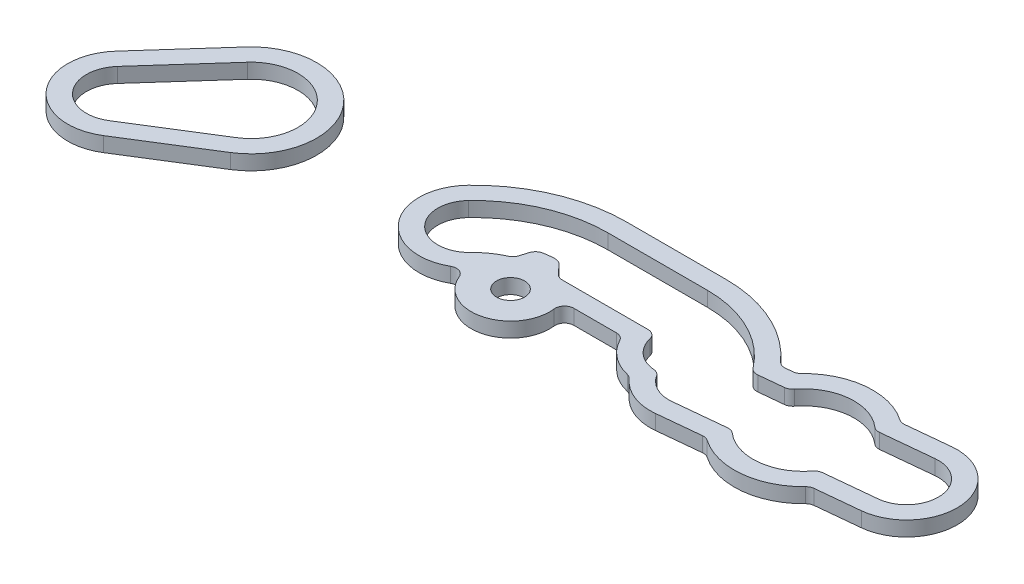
ISO-10303-21;
HEADER;
FILE_DESCRIPTION(('STEP AP214'),'2;1');
FILE_NAME('part.step','',(''),(''),'','','');
FILE_SCHEMA(('AUTOMOTIVE_DESIGN { 1 0 10303 214 1 1 1 1 }'));
ENDSEC;
DATA;
#1=APPLICATION_CONTEXT('core data for automotive mechanical design processes');
#2=APPLICATION_PROTOCOL_DEFINITION('international standard','automotive_design',2000,#1);
#3=PRODUCT_CONTEXT('',#1,'mechanical');
#4=PRODUCT('Part','Part','',(#3));
#5=PRODUCT_RELATED_PRODUCT_CATEGORY('part','',(#4));
#6=PRODUCT_DEFINITION_FORMATION('','',#4);
#7=PRODUCT_DEFINITION_CONTEXT('part definition',#1,'design');
#8=PRODUCT_DEFINITION('design','',#6,#7);
#9=PRODUCT_DEFINITION_SHAPE('','',#8);
#10=(LENGTH_UNIT() NAMED_UNIT(*) SI_UNIT(.MILLI.,.METRE.));
#11=(NAMED_UNIT(*) PLANE_ANGLE_UNIT() SI_UNIT($,.RADIAN.));
#12=(NAMED_UNIT(*) SI_UNIT($,.STERADIAN.) SOLID_ANGLE_UNIT());
#13=UNCERTAINTY_MEASURE_WITH_UNIT(LENGTH_MEASURE(1.E-05),#10,'distance_accuracy_value','');
#14=(GEOMETRIC_REPRESENTATION_CONTEXT(3) GLOBAL_UNCERTAINTY_ASSIGNED_CONTEXT((#13)) GLOBAL_UNIT_ASSIGNED_CONTEXT((#10,
#11,#12)) REPRESENTATION_CONTEXT('',''));
#15=CARTESIAN_POINT('',(0.,0.,0.));
#16=DIRECTION('',(0.,0.,1.));
#17=DIRECTION('',(1.,0.,0.));
#18=AXIS2_PLACEMENT_3D('',#15,#16,#17);
#19=CARTESIAN_POINT('',(13.,-51.41,0.));
#20=DIRECTION('',(0.,-1.,0.));
#21=DIRECTION('',(0.,0.,-1.));
#22=AXIS2_PLACEMENT_3D('',#19,#20,#21);
#23=CYLINDRICAL_SURFACE('',#22,3.5);
#24=CARTESIAN_POINT('',(13.,-52.2,0.));
#25=DIRECTION('',(0.,-1.,0.));
#26=DIRECTION('',(0.,0.,-1.));
#27=AXIS2_PLACEMENT_3D('',#24,#25,#26);
#28=CIRCLE('',#27,3.5);
#29=CARTESIAN_POINT('',(10.390788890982,-52.2,-2.33281319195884));
#30=VERTEX_POINT('',#29);
#31=CARTESIAN_POINT('',(14.8547540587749,-52.2,2.96814544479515));
#32=VERTEX_POINT('',#31);
#33=EDGE_CURVE('E149',#30,#32,#28,.T.);
#34=ORIENTED_EDGE('',*,*,#33,.F.);
#35=DIRECTION('',(0.,-1.,0.));
#36=VECTOR('',#35,1.);
#37=CARTESIAN_POINT('',(10.390788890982,-51.41,-2.33281319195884));
#38=LINE('',#37,#36);
#39=CARTESIAN_POINT('',(10.390788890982,-51.41,-2.33281319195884));
#40=VERTEX_POINT('',#39);
#41=EDGE_CURVE('E12',#40,#30,#38,.T.);
#42=ORIENTED_EDGE('',*,*,#41,.F.);
#43=CARTESIAN_POINT('',(13.,-51.41,0.));
#44=DIRECTION('',(0.,-1.,0.));
#45=DIRECTION('',(0.,0.,-1.));
#46=AXIS2_PLACEMENT_3D('',#43,#44,#45);
#47=CIRCLE('',#46,3.5);
#48=CARTESIAN_POINT('',(14.8547540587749,-51.41,2.96814544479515));
#49=VERTEX_POINT('',#48);
#50=EDGE_CURVE('E153',#40,#49,#47,.T.);
#51=ORIENTED_EDGE('',*,*,#50,.T.);
#52=DIRECTION('',(0.,-1.,0.));
#53=VECTOR('',#52,1.);
#54=CARTESIAN_POINT('',(14.8547540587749,-51.41,2.96814544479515));
#55=LINE('',#54,#53);
#56=EDGE_CURVE('E54',#49,#32,#55,.T.);
#57=ORIENTED_EDGE('',*,*,#56,.T.);
#58=EDGE_LOOP('',(#34,#42,#51,#57));
#59=FACE_BOUND('',#58,.T.);
#60=ADVANCED_FACE('F51',(#59),#23,.T.);
#61=CARTESIAN_POINT('',(7.11263111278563,-51.41,1.33374944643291));
#62=DIRECTION('',(-0.745488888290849,0.,-0.666518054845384));
#63=DIRECTION('',(-0.666518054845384,0.,0.745488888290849));
#64=AXIS2_PLACEMENT_3D('',#61,#62,#63);
#65=PLANE('',#64);
#66=DIRECTION('',(0.666518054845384,0.,-0.745488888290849));
#67=VECTOR('',#66,1.);
#68=CARTESIAN_POINT('',(7.11263111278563,-52.2,1.33374944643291));
#69=LINE('',#68,#67);
#70=CARTESIAN_POINT('',(7.11263111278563,-52.2,1.33374944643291));
#71=VERTEX_POINT('',#70);
#72=EDGE_CURVE('E157',#71,#30,#69,.T.);
#73=ORIENTED_EDGE('',*,*,#72,.F.);
#74=DIRECTION('',(0.,-1.,0.));
#75=VECTOR('',#74,1.);
#76=CARTESIAN_POINT('',(7.11263111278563,-51.41,1.33374944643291));
#77=LINE('',#76,#75);
#78=CARTESIAN_POINT('',(7.11263111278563,-51.41,1.33374944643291));
#79=VERTEX_POINT('',#78);
#80=EDGE_CURVE('E59',#79,#71,#77,.T.);
#81=ORIENTED_EDGE('',*,*,#80,.F.);
#82=DIRECTION('',(0.666518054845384,0.,-0.745488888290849));
#83=VECTOR('',#82,1.);
#84=CARTESIAN_POINT('',(7.11263111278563,-51.41,1.33374944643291));
#85=LINE('',#84,#83);
#86=EDGE_CURVE('E163',#79,#40,#85,.T.);
#87=ORIENTED_EDGE('',*,*,#86,.T.);
#88=ORIENTED_EDGE('',*,*,#41,.T.);
#89=EDGE_LOOP('',(#73,#81,#87,#88));
#90=FACE_BOUND('',#89,.T.);
#91=ADVANCED_FACE('F189',(#90),#65,.T.);
#92=CARTESIAN_POINT('',(9.2,-51.41,3.2));
#93=DIRECTION('',(0.,-1.,0.));
#94=DIRECTION('',(0.,0.,-1.));
#95=AXIS2_PLACEMENT_3D('',#92,#93,#94);
#96=CYLINDRICAL_SURFACE('',#95,2.8);
#97=CARTESIAN_POINT('',(9.2,-52.2,3.2));
#98=DIRECTION('',(0.,-1.,0.));
#99=DIRECTION('',(0.,0.,-1.));
#100=AXIS2_PLACEMENT_3D('',#97,#98,#99);
#101=CIRCLE('',#100,2.8);
#102=CARTESIAN_POINT('',(10.6838032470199,-52.2,5.57451635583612));
#103=VERTEX_POINT('',#102);
#104=EDGE_CURVE('E171',#103,#71,#101,.T.);
#105=ORIENTED_EDGE('',*,*,#104,.F.);
#106=DIRECTION('',(0.,-1.,0.));
#107=VECTOR('',#106,1.);
#108=CARTESIAN_POINT('',(10.6838032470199,-51.41,5.57451635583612));
#109=LINE('',#108,#107);
#110=CARTESIAN_POINT('',(10.6838032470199,-51.41,5.57451635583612));
#111=VERTEX_POINT('',#110);
#112=EDGE_CURVE('E176',#111,#103,#109,.T.);
#113=ORIENTED_EDGE('',*,*,#112,.F.);
#114=CARTESIAN_POINT('',(9.2,-51.41,3.2));
#115=DIRECTION('',(0.,-1.,0.));
#116=DIRECTION('',(0.,0.,-1.));
#117=AXIS2_PLACEMENT_3D('',#114,#115,#116);
#118=CIRCLE('',#117,2.8);
#119=EDGE_CURVE('E160',#111,#79,#118,.T.);
#120=ORIENTED_EDGE('',*,*,#119,.T.);
#121=ORIENTED_EDGE('',*,*,#80,.T.);
#122=EDGE_LOOP('',(#105,#113,#120,#121));
#123=FACE_BOUND('',#122,.T.);
#124=ADVANCED_FACE('F193',(#123),#96,.T.);
#125=CARTESIAN_POINT('',(14.8547540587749,-51.41,2.96814544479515));
#126=DIRECTION('',(0.529929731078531,0.,0.848041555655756));
#127=DIRECTION('',(0.848041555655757,0.,-0.529929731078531));
#128=AXIS2_PLACEMENT_3D('',#125,#126,#127);
#129=PLANE('',#128);
#130=DIRECTION('',(-0.848041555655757,0.,0.529929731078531));
#131=VECTOR('',#130,1.);
#132=CARTESIAN_POINT('',(14.8547540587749,-52.2,2.96814544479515));
#133=LINE('',#132,#131);
#134=EDGE_CURVE('E168',#32,#103,#133,.T.);
#135=ORIENTED_EDGE('',*,*,#134,.F.);
#136=ORIENTED_EDGE('',*,*,#56,.F.);
#137=DIRECTION('',(-0.848041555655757,0.,0.529929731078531));
#138=VECTOR('',#137,1.);
#139=CARTESIAN_POINT('',(14.8547540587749,-51.41,2.96814544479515));
#140=LINE('',#139,#138);
#141=EDGE_CURVE('E156',#49,#111,#140,.T.);
#142=ORIENTED_EDGE('',*,*,#141,.T.);
#143=ORIENTED_EDGE('',*,*,#112,.T.);
#144=EDGE_LOOP('',(#135,#136,#142,#143));
#145=FACE_BOUND('',#144,.T.);
#146=ADVANCED_FACE('F184',(#145),#129,.T.);
#147=CARTESIAN_POINT('',(13.,-51.41,0.));
#148=DIRECTION('',(0.,-1.,0.));
#149=DIRECTION('',(0.,0.,-1.));
#150=AXIS2_PLACEMENT_3D('',#147,#148,#149);
#151=PLANE('',#150);
#152=DIRECTION('',(0.666518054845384,0.,-0.745488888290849));
#153=VECTOR('',#152,1.);
#154=CARTESIAN_POINT('',(7.85812000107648,-51.41,2.0002675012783));
#155=LINE('',#154,#153);
#156=CARTESIAN_POINT('',(7.85812000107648,-51.41,2.0002675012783));
#157=VERTEX_POINT('',#156);
#158=CARTESIAN_POINT('',(11.1362777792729,-51.41,-1.66629513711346));
#159=VERTEX_POINT('',#158);
#160=EDGE_CURVE('E124',#157,#159,#155,.T.);
#161=ORIENTED_EDGE('',*,*,#160,.T.);
#162=CARTESIAN_POINT('',(13.,-51.41,0.));
#163=DIRECTION('',(0.,-1.,0.));
#164=DIRECTION('',(0.,0.,-1.));
#165=AXIS2_PLACEMENT_3D('',#162,#163,#164);
#166=CIRCLE('',#165,2.5);
#167=CARTESIAN_POINT('',(14.3248243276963,-51.41,2.12010388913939));
#168=VERTEX_POINT('',#167);
#169=EDGE_CURVE('E118',#159,#168,#166,.T.);
#170=ORIENTED_EDGE('',*,*,#169,.T.);
#171=DIRECTION('',(-0.848041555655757,0.,0.529929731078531));
#172=VECTOR('',#171,1.);
#173=CARTESIAN_POINT('',(14.3248243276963,-51.41,2.12010388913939));
#174=LINE('',#173,#172);
#175=CARTESIAN_POINT('',(10.1538735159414,-51.41,4.72647480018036));
#176=VERTEX_POINT('',#175);
#177=EDGE_CURVE('E127',#168,#176,#174,.T.);
#178=ORIENTED_EDGE('',*,*,#177,.T.);
#179=CARTESIAN_POINT('',(9.2,-51.41,3.2));
#180=DIRECTION('',(0.,-1.,0.));
#181=DIRECTION('',(0.,0.,-1.));
#182=AXIS2_PLACEMENT_3D('',#179,#180,#181);
#183=CIRCLE('',#182,1.8);
#184=EDGE_CURVE('E67',#176,#157,#183,.T.);
#185=ORIENTED_EDGE('',*,*,#184,.T.);
#186=EDGE_LOOP('',(#161,#170,#178,#185));
#187=FACE_BOUND('',#186,.T.);
#188=ORIENTED_EDGE('',*,*,#50,.F.);
#189=ORIENTED_EDGE('',*,*,#86,.F.);
#190=ORIENTED_EDGE('',*,*,#119,.F.);
#191=ORIENTED_EDGE('',*,*,#141,.F.);
#192=EDGE_LOOP('',(#188,#189,#190,#191));
#193=FACE_BOUND('',#192,.T.);
#194=ADVANCED_FACE('F131',(#187,#193),#151,.F.);
#195=CARTESIAN_POINT('',(13.,-52.2,0.));
#196=DIRECTION('',(0.,-1.,0.));
#197=DIRECTION('',(0.,0.,-1.));
#198=AXIS2_PLACEMENT_3D('',#195,#196,#197);
#199=PLANE('',#198);
#200=CARTESIAN_POINT('',(13.,-52.2,0.));
#201=DIRECTION('',(0.,-1.,0.));
#202=DIRECTION('',(0.,0.,-1.));
#203=AXIS2_PLACEMENT_3D('',#200,#201,#202);
#204=CIRCLE('',#203,2.5);
#205=CARTESIAN_POINT('',(11.1362777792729,-52.2,-1.66629513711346));
#206=VERTEX_POINT('',#205);
#207=CARTESIAN_POINT('',(14.3248243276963,-52.2,2.12010388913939));
#208=VERTEX_POINT('',#207);
#209=EDGE_CURVE('E75',#206,#208,#204,.T.);
#210=ORIENTED_EDGE('',*,*,#209,.F.);
#211=DIRECTION('',(0.666518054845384,0.,-0.745488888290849));
#212=VECTOR('',#211,1.);
#213=CARTESIAN_POINT('',(7.85812000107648,-52.2,2.0002675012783));
#214=LINE('',#213,#212);
#215=CARTESIAN_POINT('',(7.85812000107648,-52.2,2.0002675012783));
#216=VERTEX_POINT('',#215);
#217=EDGE_CURVE('E134',#216,#206,#214,.T.);
#218=ORIENTED_EDGE('',*,*,#217,.F.);
#219=CARTESIAN_POINT('',(9.2,-52.2,3.2));
#220=DIRECTION('',(0.,-1.,0.));
#221=DIRECTION('',(0.,0.,-1.));
#222=AXIS2_PLACEMENT_3D('',#219,#220,#221);
#223=CIRCLE('',#222,1.8);
#224=CARTESIAN_POINT('',(10.1538735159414,-52.2,4.72647480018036));
#225=VERTEX_POINT('',#224);
#226=EDGE_CURVE('E137',#225,#216,#223,.T.);
#227=ORIENTED_EDGE('',*,*,#226,.F.);
#228=DIRECTION('',(-0.848041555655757,0.,0.529929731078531));
#229=VECTOR('',#228,1.);
#230=CARTESIAN_POINT('',(14.3248243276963,-52.2,2.12010388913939));
#231=LINE('',#230,#229);
#232=EDGE_CURVE('E143',#208,#225,#231,.T.);
#233=ORIENTED_EDGE('',*,*,#232,.F.);
#234=EDGE_LOOP('',(#210,#218,#227,#233));
#235=FACE_BOUND('',#234,.T.);
#236=ORIENTED_EDGE('',*,*,#33,.T.);
#237=ORIENTED_EDGE('',*,*,#134,.T.);
#238=ORIENTED_EDGE('',*,*,#104,.T.);
#239=ORIENTED_EDGE('',*,*,#72,.T.);
#240=EDGE_LOOP('',(#236,#237,#238,#239));
#241=FACE_BOUND('',#240,.T.);
#242=ADVANCED_FACE('F186',(#235,#241),#199,.T.);
#243=CARTESIAN_POINT('',(13.,-51.41,0.));
#244=DIRECTION('',(0.,-1.,0.));
#245=DIRECTION('',(0.,0.,-1.));
#246=AXIS2_PLACEMENT_3D('',#243,#244,#245);
#247=CYLINDRICAL_SURFACE('',#246,2.5);
#248=ORIENTED_EDGE('',*,*,#209,.T.);
#249=DIRECTION('',(0.,-1.,0.));
#250=VECTOR('',#249,1.);
#251=CARTESIAN_POINT('',(14.3248243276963,-51.41,2.12010388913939));
#252=LINE('',#251,#250);
#253=EDGE_CURVE('E114',#168,#208,#252,.T.);
#254=ORIENTED_EDGE('',*,*,#253,.F.);
#255=ORIENTED_EDGE('',*,*,#169,.F.);
#256=DIRECTION('',(0.,-1.,0.));
#257=VECTOR('',#256,1.);
#258=CARTESIAN_POINT('',(11.1362777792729,-51.41,-1.66629513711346));
#259=LINE('',#258,#257);
#260=EDGE_CURVE('E147',#159,#206,#259,.T.);
#261=ORIENTED_EDGE('',*,*,#260,.T.);
#262=EDGE_LOOP('',(#248,#254,#255,#261));
#263=FACE_BOUND('',#262,.T.);
#264=ADVANCED_FACE('F116',(#263),#247,.F.);
#265=CARTESIAN_POINT('',(7.85812000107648,-51.41,2.0002675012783));
#266=DIRECTION('',(-0.745488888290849,0.,-0.666518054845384));
#267=DIRECTION('',(-0.666518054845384,0.,0.745488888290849));
#268=AXIS2_PLACEMENT_3D('',#265,#266,#267);
#269=PLANE('',#268);
#270=ORIENTED_EDGE('',*,*,#217,.T.);
#271=ORIENTED_EDGE('',*,*,#260,.F.);
#272=ORIENTED_EDGE('',*,*,#160,.F.);
#273=DIRECTION('',(0.,-1.,0.));
#274=VECTOR('',#273,1.);
#275=CARTESIAN_POINT('',(7.85812000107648,-51.41,2.0002675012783));
#276=LINE('',#275,#274);
#277=EDGE_CURVE('E150',#157,#216,#276,.T.);
#278=ORIENTED_EDGE('',*,*,#277,.T.);
#279=EDGE_LOOP('',(#270,#271,#272,#278));
#280=FACE_BOUND('',#279,.T.);
#281=ADVANCED_FACE('F244',(#280),#269,.F.);
#282=CARTESIAN_POINT('',(9.2,-51.41,3.2));
#283=DIRECTION('',(0.,-1.,0.));
#284=DIRECTION('',(0.,0.,-1.));
#285=AXIS2_PLACEMENT_3D('',#282,#283,#284);
#286=CYLINDRICAL_SURFACE('',#285,1.8);
#287=ORIENTED_EDGE('',*,*,#226,.T.);
#288=ORIENTED_EDGE('',*,*,#277,.F.);
#289=ORIENTED_EDGE('',*,*,#184,.F.);
#290=DIRECTION('',(0.,-1.,0.));
#291=VECTOR('',#290,1.);
#292=CARTESIAN_POINT('',(10.1538735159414,-51.41,4.72647480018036));
#293=LINE('',#292,#291);
#294=EDGE_CURVE('E123',#176,#225,#293,.T.);
#295=ORIENTED_EDGE('',*,*,#294,.T.);
#296=EDGE_LOOP('',(#287,#288,#289,#295));
#297=FACE_BOUND('',#296,.T.);
#298=ADVANCED_FACE('F253',(#297),#286,.F.);
#299=CARTESIAN_POINT('',(14.3248243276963,-51.41,2.12010388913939));
#300=DIRECTION('',(0.529929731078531,0.,0.848041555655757));
#301=DIRECTION('',(0.848041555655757,0.,-0.529929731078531));
#302=AXIS2_PLACEMENT_3D('',#299,#300,#301);
#303=PLANE('',#302);
#304=ORIENTED_EDGE('',*,*,#232,.T.);
#305=ORIENTED_EDGE('',*,*,#294,.F.);
#306=ORIENTED_EDGE('',*,*,#177,.F.);
#307=ORIENTED_EDGE('',*,*,#253,.T.);
#308=EDGE_LOOP('',(#304,#305,#306,#307));
#309=FACE_BOUND('',#308,.T.);
#310=ADVANCED_FACE('F128',(#309),#303,.F.);
#311=CLOSED_SHELL('',(#60,#91,#124,#146,#194,#242,#264,#281,#298,#310));
#312=MANIFOLD_SOLID_BREP('B2',#311);
#313=CARTESIAN_POINT('',(24.6666666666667,-51.41,0.));
#314=DIRECTION('',(0.,-1.,0.));
#315=DIRECTION('',(0.,0.,-1.));
#316=AXIS2_PLACEMENT_3D('',#313,#314,#315);
#317=CYLINDRICAL_SURFACE('',#316,2.7);
#318=CARTESIAN_POINT('',(24.6666666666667,-52.2,0.));
#319=DIRECTION('',(0.,-1.,0.));
#320=DIRECTION('',(0.,0.,-1.));
#321=AXIS2_PLACEMENT_3D('',#318,#319,#320);
#322=CIRCLE('',#321,2.7);
#323=CARTESIAN_POINT('',(25.9971963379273,-52.2,2.34940222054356));
#324=VERTEX_POINT('',#323);
#325=CARTESIAN_POINT('',(22.7171487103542,-52.2,-1.8679881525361));
#326=VERTEX_POINT('',#325);
#327=EDGE_CURVE('E745',#324,#326,#322,.T.);
#328=ORIENTED_EDGE('',*,*,#327,.F.);
#329=DIRECTION('',(0.,-1.,0.));
#330=VECTOR('',#329,1.);
#331=CARTESIAN_POINT('',(25.9971963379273,-51.41,2.34940222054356));
#332=LINE('',#331,#330);
#333=CARTESIAN_POINT('',(25.9971963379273,-51.41,2.34940222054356));
#334=VERTEX_POINT('',#333);
#335=EDGE_CURVE('E907',#324,#334,#332,.F.);
#336=ORIENTED_EDGE('',*,*,#335,.T.);
#337=CARTESIAN_POINT('',(24.6666666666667,-51.41,0.));
#338=DIRECTION('',(0.,-1.,0.));
#339=DIRECTION('',(0.,0.,-1.));
#340=AXIS2_PLACEMENT_3D('',#337,#338,#339);
#341=CIRCLE('',#340,2.7);
#342=CARTESIAN_POINT('',(22.7171487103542,-51.41,-1.8679881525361));
#343=VERTEX_POINT('',#342);
#344=EDGE_CURVE('E748',#334,#343,#341,.T.);
#345=ORIENTED_EDGE('',*,*,#344,.T.);
#346=DIRECTION('',(0.,-1.,0.));
#347=VECTOR('',#346,1.);
#348=CARTESIAN_POINT('',(22.7171487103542,-51.41,-1.8679881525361));
#349=LINE('',#348,#347);
#350=EDGE_CURVE('E789',#343,#326,#349,.T.);
#351=ORIENTED_EDGE('',*,*,#350,.T.);
#352=EDGE_LOOP('',(#328,#336,#345,#351));
#353=FACE_BOUND('',#352,.T.);
#354=ADVANCED_FACE('F281',(#353),#317,.T.);
#355=CARTESIAN_POINT('',(28.65,-51.41,1.8));
#356=DIRECTION('',(0.,-1.,0.));
#357=DIRECTION('',(0.,0.,-1.));
#358=AXIS2_PLACEMENT_3D('',#355,#356,#357);
#359=CYLINDRICAL_SURFACE('',#358,2.1);
#360=CARTESIAN_POINT('',(28.65,-51.41,1.8));
#361=DIRECTION('',(0.,-1.,0.));
#362=DIRECTION('',(0.,0.,-1.));
#363=AXIS2_PLACEMENT_3D('',#360,#361,#362);
#364=CIRCLE('',#363,2.1);
#365=CARTESIAN_POINT('',(30.7359738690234,-51.41,1.55769230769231));
#366=VERTEX_POINT('',#365);
#367=CARTESIAN_POINT('',(26.7063617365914,-51.41,2.59515426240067));
#368=VERTEX_POINT('',#367);
#369=EDGE_CURVE('E786',#366,#368,#364,.T.);
#370=ORIENTED_EDGE('',*,*,#369,.T.);
#371=DIRECTION('',(0.,-1.,0.));
#372=VECTOR('',#371,1.);
#373=CARTESIAN_POINT('',(26.7063617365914,-51.41,2.59515426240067));
#374=LINE('',#373,#372);
#375=CARTESIAN_POINT('',(26.7063617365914,-52.2,2.59515426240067));
#376=VERTEX_POINT('',#375);
#377=EDGE_CURVE('E904',#368,#376,#374,.T.);
#378=ORIENTED_EDGE('',*,*,#377,.T.);
#379=CARTESIAN_POINT('',(28.65,-52.2,1.8));
#380=DIRECTION('',(0.,-1.,0.));
#381=DIRECTION('',(0.,0.,-1.));
#382=AXIS2_PLACEMENT_3D('',#379,#380,#381);
#383=CIRCLE('',#382,2.1);
#384=CARTESIAN_POINT('',(30.7359738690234,-52.2,1.55769230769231));
#385=VERTEX_POINT('',#384);
#386=EDGE_CURVE('E751',#385,#376,#383,.T.);
#387=ORIENTED_EDGE('',*,*,#386,.F.);
#388=DIRECTION('',(0.,-1.,0.));
#389=VECTOR('',#388,1.);
#390=CARTESIAN_POINT('',(30.7359738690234,-51.41,1.55769230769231));
#391=LINE('',#390,#389);
#392=EDGE_CURVE('E902',#385,#366,#391,.F.);
#393=ORIENTED_EDGE('',*,*,#392,.T.);
#394=EDGE_LOOP('',(#370,#378,#387,#393));
#395=FACE_BOUND('',#394,.T.);
#396=ADVANCED_FACE('F1113',(#395),#359,.T.);
#397=CARTESIAN_POINT('',(33.8253460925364,-51.41,1.));
#398=DIRECTION('',(0.,0.,1.));
#399=DIRECTION('',(1.,0.,0.));
#400=AXIS2_PLACEMENT_3D('',#397,#398,#399);
#401=PLANE('',#400);
#402=DIRECTION('',(-1.,0.,0.));
#403=VECTOR('',#402,1.);
#404=CARTESIAN_POINT('',(33.8253460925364,-51.41,1.));
#405=LINE('',#404,#403);
#406=CARTESIAN_POINT('',(33.5066745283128,-51.41,1.));
#407=VERTEX_POINT('',#406);
#408=CARTESIAN_POINT('',(31.232634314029,-51.41,1.));
#409=VERTEX_POINT('',#408);
#410=EDGE_CURVE('E783',#407,#409,#405,.T.);
#411=ORIENTED_EDGE('',*,*,#410,.T.);
#412=DIRECTION('',(0.,1.,0.));
#413=VECTOR('',#412,1.);
#414=CARTESIAN_POINT('',(31.232634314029,-52.2,1.));
#415=LINE('',#414,#413);
#416=CARTESIAN_POINT('',(31.232634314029,-52.2,1.));
#417=VERTEX_POINT('',#416);
#418=EDGE_CURVE('E911',#409,#417,#415,.F.);
#419=ORIENTED_EDGE('',*,*,#418,.T.);
#420=DIRECTION('',(-1.,0.,0.));
#421=VECTOR('',#420,1.);
#422=CARTESIAN_POINT('',(33.8253460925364,-52.2,1.));
#423=LINE('',#422,#421);
#424=CARTESIAN_POINT('',(33.5066745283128,-52.2,1.));
#425=VERTEX_POINT('',#424);
#426=EDGE_CURVE('E825',#425,#417,#423,.T.);
#427=ORIENTED_EDGE('',*,*,#426,.F.);
#428=DIRECTION('',(0.,1.,0.));
#429=VECTOR('',#428,1.);
#430=CARTESIAN_POINT('',(33.5066745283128,-51.41,1.));
#431=LINE('',#430,#429);
#432=EDGE_CURVE('E909',#425,#407,#431,.T.);
#433=ORIENTED_EDGE('',*,*,#432,.T.);
#434=EDGE_LOOP('',(#411,#419,#427,#433));
#435=FACE_BOUND('',#434,.T.);
#436=ADVANCED_FACE('F1023',(#435),#401,.T.);
#437=CARTESIAN_POINT('',(36.3333333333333,-51.41,0.));
#438=DIRECTION('',(0.,-1.,0.));
#439=DIRECTION('',(0.,0.,-1.));
#440=AXIS2_PLACEMENT_3D('',#437,#438,#439);
#441=CYLINDRICAL_SURFACE('',#440,2.7);
#442=CARTESIAN_POINT('',(36.3333333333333,-52.2,0.));
#443=DIRECTION('',(0.,-1.,0.));
#444=DIRECTION('',(0.,0.,-1.));
#445=AXIS2_PLACEMENT_3D('',#442,#443,#444);
#446=CIRCLE('',#445,2.7);
#447=CARTESIAN_POINT('',(35.7129299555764,-52.2,2.62775562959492));
#448=VERTEX_POINT('',#447);
#449=CARTESIAN_POINT('',(33.9483399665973,-52.2,1.265625));
#450=VERTEX_POINT('',#449);
#451=EDGE_CURVE('E822',#448,#450,#446,.T.);
#452=ORIENTED_EDGE('',*,*,#451,.F.);
#453=DIRECTION('',(0.,-1.,0.));
#454=VECTOR('',#453,1.);
#455=CARTESIAN_POINT('',(35.7129299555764,-51.41,2.62775562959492));
#456=LINE('',#455,#454);
#457=CARTESIAN_POINT('',(35.7129299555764,-51.41,2.62775562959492));
#458=VERTEX_POINT('',#457);
#459=EDGE_CURVE('E977',#448,#458,#456,.F.);
#460=ORIENTED_EDGE('',*,*,#459,.T.);
#461=CARTESIAN_POINT('',(36.3333333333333,-51.41,0.));
#462=DIRECTION('',(0.,-1.,0.));
#463=DIRECTION('',(0.,0.,-1.));
#464=AXIS2_PLACEMENT_3D('',#461,#462,#463);
#465=CIRCLE('',#464,2.7);
#466=CARTESIAN_POINT('',(33.9483399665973,-51.41,1.265625));
#467=VERTEX_POINT('',#466);
#468=EDGE_CURVE('E780',#458,#467,#465,.T.);
#469=ORIENTED_EDGE('',*,*,#468,.T.);
#470=DIRECTION('',(0.,-1.,0.));
#471=VECTOR('',#470,1.);
#472=CARTESIAN_POINT('',(33.9483399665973,-51.41,1.265625));
#473=LINE('',#472,#471);
#474=EDGE_CURVE('E974',#467,#450,#473,.T.);
#475=ORIENTED_EDGE('',*,*,#474,.T.);
#476=EDGE_LOOP('',(#452,#460,#469,#475));
#477=FACE_BOUND('',#476,.T.);
#478=ADVANCED_FACE('F1031',(#477),#441,.T.);
#479=CARTESIAN_POINT('',(38.,-51.41,1.));
#480=DIRECTION('',(0.,-1.,0.));
#481=DIRECTION('',(0.,0.,-1.));
#482=AXIS2_PLACEMENT_3D('',#479,#480,#481);
#483=CYLINDRICAL_SURFACE('',#482,2.7);
#484=CARTESIAN_POINT('',(38.,-51.41,1.));
#485=DIRECTION('',(0.,-1.,0.));
#486=DIRECTION('',(0.,0.,-1.));
#487=AXIS2_PLACEMENT_3D('',#484,#485,#486);
#488=CIRCLE('',#487,2.7);
#489=CARTESIAN_POINT('',(38.2686600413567,-51.41,3.68660041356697));
#490=VERTEX_POINT('',#489);
#491=CARTESIAN_POINT('',(35.973346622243,-51.41,2.78400562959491));
#492=VERTEX_POINT('',#491);
#493=EDGE_CURVE('E777',#490,#492,#488,.T.);
#494=ORIENTED_EDGE('',*,*,#493,.T.);
#495=DIRECTION('',(0.,-1.,0.));
#496=VECTOR('',#495,1.);
#497=CARTESIAN_POINT('',(35.973346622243,-51.41,2.78400562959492));
#498=LINE('',#497,#496);
#499=CARTESIAN_POINT('',(35.973346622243,-52.2,2.78400562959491));
#500=VERTEX_POINT('',#499);
#501=EDGE_CURVE('E971',#492,#500,#498,.T.);
#502=ORIENTED_EDGE('',*,*,#501,.T.);
#503=CARTESIAN_POINT('',(38.,-52.2,1.));
#504=DIRECTION('',(0.,-1.,0.));
#505=DIRECTION('',(0.,0.,-1.));
#506=AXIS2_PLACEMENT_3D('',#503,#504,#505);
#507=CIRCLE('',#506,2.7);
#508=CARTESIAN_POINT('',(38.2686600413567,-52.2,3.68660041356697));
#509=VERTEX_POINT('',#508);
#510=EDGE_CURVE('E819',#509,#500,#507,.T.);
#511=ORIENTED_EDGE('',*,*,#510,.F.);
#512=DIRECTION('',(0.,-1.,0.));
#513=VECTOR('',#512,1.);
#514=CARTESIAN_POINT('',(38.2686600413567,-51.41,3.68660041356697));
#515=LINE('',#514,#513);
#516=EDGE_CURVE('E830',#490,#509,#515,.T.);
#517=ORIENTED_EDGE('',*,*,#516,.F.);
#518=EDGE_LOOP('',(#494,#502,#511,#517));
#519=FACE_BOUND('',#518,.T.);
#520=ADVANCED_FACE('F1040',(#519),#483,.T.);
#521=CARTESIAN_POINT('',(40.7513929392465,-51.41,3.43832712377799));
#522=DIRECTION('',(0.0995037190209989,0.,0.995037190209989));
#523=DIRECTION('',(0.995037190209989,0.,-0.0995037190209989));
#524=AXIS2_PLACEMENT_3D('',#521,#522,#523);
#525=PLANE('',#524);
#526=DIRECTION('',(-0.995037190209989,0.,0.0995037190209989));
#527=VECTOR('',#526,1.);
#528=CARTESIAN_POINT('',(40.7513929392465,-52.2,3.43832712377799));
#529=LINE('',#528,#527);
#530=CARTESIAN_POINT('',(40.5618662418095,-52.2,3.45727979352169));
#531=VERTEX_POINT('',#530);
#532=EDGE_CURVE('E817',#531,#509,#529,.T.);
#533=ORIENTED_EDGE('',*,*,#532,.F.);
#534=DIRECTION('',(0.,1.,0.));
#535=VECTOR('',#534,1.);
#536=CARTESIAN_POINT('',(40.5618662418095,-51.41,3.45727979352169));
#537=LINE('',#536,#535);
#538=CARTESIAN_POINT('',(40.5618662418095,-51.41,3.45727979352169));
#539=VERTEX_POINT('',#538);
#540=EDGE_CURVE('E969',#531,#539,#537,.T.);
#541=ORIENTED_EDGE('',*,*,#540,.T.);
#542=DIRECTION('',(-0.995037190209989,0.,0.0995037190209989));
#543=VECTOR('',#542,1.);
#544=CARTESIAN_POINT('',(40.7513929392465,-51.41,3.43832712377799));
#545=LINE('',#544,#543);
#546=EDGE_CURVE('E775',#539,#490,#545,.T.);
#547=ORIENTED_EDGE('',*,*,#546,.T.);
#548=ORIENTED_EDGE('',*,*,#516,.T.);
#549=EDGE_LOOP('',(#533,#541,#547,#548));
#550=FACE_BOUND('',#549,.T.);
#551=ADVANCED_FACE('F1044',(#550),#525,.T.);
#552=CARTESIAN_POINT('',(43.,-51.41,0.5));
#553=DIRECTION('',(0.,-1.,0.));
#554=DIRECTION('',(0.,0.,-1.));
#555=AXIS2_PLACEMENT_3D('',#552,#553,#554);
#556=CYLINDRICAL_SURFACE('',#555,3.7);
#557=CARTESIAN_POINT('',(43.,-52.2,0.5));
#558=DIRECTION('',(0.,-1.,0.));
#559=DIRECTION('',(0.,0.,-1.));
#560=AXIS2_PLACEMENT_3D('',#557,#558,#559);
#561=CIRCLE('',#560,3.7);
#562=CARTESIAN_POINT('',(45.6650621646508,-52.2,3.06660157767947));
#563=VERTEX_POINT('',#562);
#564=CARTESIAN_POINT('',(40.8959492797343,-52.2,3.54351286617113));
#565=VERTEX_POINT('',#564);
#566=EDGE_CURVE('E814',#563,#565,#561,.T.);
#567=ORIENTED_EDGE('',*,*,#566,.F.);
#568=DIRECTION('',(0.,-1.,0.));
#569=VECTOR('',#568,1.);
#570=CARTESIAN_POINT('',(45.6650621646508,-51.41,3.06660157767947));
#571=LINE('',#570,#569);
#572=CARTESIAN_POINT('',(45.6650621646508,-51.41,3.06660157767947));
#573=VERTEX_POINT('',#572);
#574=EDGE_CURVE('E952',#563,#573,#571,.F.);
#575=ORIENTED_EDGE('',*,*,#574,.T.);
#576=CARTESIAN_POINT('',(43.,-51.41,0.5));
#577=DIRECTION('',(0.,-1.,0.));
#578=DIRECTION('',(0.,0.,-1.));
#579=AXIS2_PLACEMENT_3D('',#576,#577,#578);
#580=CIRCLE('',#579,3.7);
#581=CARTESIAN_POINT('',(40.8959492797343,-51.41,3.54351286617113));
#582=VERTEX_POINT('',#581);
#583=EDGE_CURVE('E772',#573,#582,#580,.T.);
#584=ORIENTED_EDGE('',*,*,#583,.T.);
#585=DIRECTION('',(0.,-1.,0.));
#586=VECTOR('',#585,1.);
#587=CARTESIAN_POINT('',(40.8959492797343,-51.41,3.54351286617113));
#588=LINE('',#587,#586);
#589=EDGE_CURVE('E949',#582,#565,#588,.T.);
#590=ORIENTED_EDGE('',*,*,#589,.T.);
#591=EDGE_LOOP('',(#567,#575,#584,#590));
#592=FACE_BOUND('',#591,.T.);
#593=ADVANCED_FACE('F1053',(#592),#556,.T.);
#594=CARTESIAN_POINT('',(48.2686600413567,-51.41,2.68660041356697));
#595=DIRECTION('',(0.0995037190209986,0.,0.995037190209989));
#596=DIRECTION('',(0.995037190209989,0.,-0.0995037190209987));
#597=AXIS2_PLACEMENT_3D('',#594,#595,#596);
#598=PLANE('',#597);
#599=DIRECTION('',(-0.995037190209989,0.,0.0995037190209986));
#600=VECTOR('',#599,1.);
#601=CARTESIAN_POINT('',(48.2686600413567,-51.41,2.68660041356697));
#602=LINE('',#601,#600);
#603=CARTESIAN_POINT('',(48.2686600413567,-51.41,2.68660041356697));
#604=VERTEX_POINT('',#603);
#605=CARTESIAN_POINT('',(45.9754538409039,-51.41,2.91592103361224));
#606=VERTEX_POINT('',#605);
#607=EDGE_CURVE('E769',#604,#606,#602,.T.);
#608=ORIENTED_EDGE('',*,*,#607,.T.);
#609=DIRECTION('',(0.,1.,0.));
#610=VECTOR('',#609,1.);
#611=CARTESIAN_POINT('',(45.9754538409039,-52.2,2.91592103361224));
#612=LINE('',#611,#610);
#613=CARTESIAN_POINT('',(45.9754538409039,-52.2,2.91592103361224));
#614=VERTEX_POINT('',#613);
#615=EDGE_CURVE('E946',#606,#614,#612,.F.);
#616=ORIENTED_EDGE('',*,*,#615,.T.);
#617=DIRECTION('',(-0.995037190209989,0.,0.0995037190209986));
#618=VECTOR('',#617,1.);
#619=CARTESIAN_POINT('',(48.2686600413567,-52.2,2.68660041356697));
#620=LINE('',#619,#618);
#621=CARTESIAN_POINT('',(48.2686600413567,-52.2,2.68660041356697));
#622=VERTEX_POINT('',#621);
#623=EDGE_CURVE('E811',#622,#614,#620,.T.);
#624=ORIENTED_EDGE('',*,*,#623,.F.);
#625=DIRECTION('',(0.,-1.,0.));
#626=VECTOR('',#625,1.);
#627=CARTESIAN_POINT('',(48.2686600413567,-51.41,2.68660041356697));
#628=LINE('',#627,#626);
#629=EDGE_CURVE('E834',#604,#622,#628,.T.);
#630=ORIENTED_EDGE('',*,*,#629,.F.);
#631=EDGE_LOOP('',(#608,#616,#624,#630));
#632=FACE_BOUND('',#631,.T.);
#633=ADVANCED_FACE('F1061',(#632),#598,.T.);
#634=CARTESIAN_POINT('',(48.,-51.41,0.));
#635=DIRECTION('',(0.,-1.,0.));
#636=DIRECTION('',(0.,0.,-1.));
#637=AXIS2_PLACEMENT_3D('',#634,#635,#636);
#638=CYLINDRICAL_SURFACE('',#637,2.7);
#639=CARTESIAN_POINT('',(48.,-52.2,0.));
#640=DIRECTION('',(0.,-1.,0.));
#641=DIRECTION('',(0.,0.,-1.));
#642=AXIS2_PLACEMENT_3D('',#639,#640,#641);
#643=CIRCLE('',#642,2.7);
#644=CARTESIAN_POINT('',(47.7313399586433,-52.2,-2.68660041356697));
#645=VERTEX_POINT('',#644);
#646=EDGE_CURVE('E808',#645,#622,#643,.T.);
#647=ORIENTED_EDGE('',*,*,#646,.F.);
#648=DIRECTION('',(0.,-1.,0.));
#649=VECTOR('',#648,1.);
#650=CARTESIAN_POINT('',(47.7313399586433,-51.41,-2.68660041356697));
#651=LINE('',#650,#649);
#652=CARTESIAN_POINT('',(47.7313399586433,-51.41,-2.68660041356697));
#653=VERTEX_POINT('',#652);
#654=EDGE_CURVE('E836',#653,#645,#651,.T.);
#655=ORIENTED_EDGE('',*,*,#654,.F.);
#656=CARTESIAN_POINT('',(48.,-51.41,0.));
#657=DIRECTION('',(0.,-1.,0.));
#658=DIRECTION('',(0.,0.,-1.));
#659=AXIS2_PLACEMENT_3D('',#656,#657,#658);
#660=CIRCLE('',#659,2.7);
#661=EDGE_CURVE('E766',#653,#604,#660,.T.);
#662=ORIENTED_EDGE('',*,*,#661,.T.);
#663=ORIENTED_EDGE('',*,*,#629,.T.);
#664=EDGE_LOOP('',(#647,#655,#662,#663));
#665=FACE_BOUND('',#664,.T.);
#666=ADVANCED_FACE('F1068',(#665),#638,.T.);
#667=CARTESIAN_POINT('',(45.2486070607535,-51.41,-2.43832712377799));
#668=DIRECTION('',(-0.0995037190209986,0.,-0.995037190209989));
#669=DIRECTION('',(-0.995037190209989,0.,0.0995037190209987));
#670=AXIS2_PLACEMENT_3D('',#667,#668,#669);
#671=PLANE('',#670);
#672=DIRECTION('',(0.995037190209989,0.,-0.0995037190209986));
#673=VECTOR('',#672,1.);
#674=CARTESIAN_POINT('',(45.2486070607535,-52.2,-2.43832712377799));
#675=LINE('',#674,#673);
#676=CARTESIAN_POINT('',(45.4381337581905,-52.2,-2.45727979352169));
#677=VERTEX_POINT('',#676);
#678=EDGE_CURVE('E806',#677,#645,#675,.T.);
#679=ORIENTED_EDGE('',*,*,#678,.F.);
#680=DIRECTION('',(0.,1.,0.));
#681=VECTOR('',#680,1.);
#682=CARTESIAN_POINT('',(45.4381337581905,-51.41,-2.45727979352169));
#683=LINE('',#682,#681);
#684=CARTESIAN_POINT('',(45.4381337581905,-51.41,-2.45727979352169));
#685=VERTEX_POINT('',#684);
#686=EDGE_CURVE('E919',#677,#685,#683,.T.);
#687=ORIENTED_EDGE('',*,*,#686,.T.);
#688=DIRECTION('',(0.995037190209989,0.,-0.0995037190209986));
#689=VECTOR('',#688,1.);
#690=CARTESIAN_POINT('',(45.2486070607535,-51.41,-2.43832712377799));
#691=LINE('',#690,#689);
#692=EDGE_CURVE('E764',#685,#653,#691,.T.);
#693=ORIENTED_EDGE('',*,*,#692,.T.);
#694=ORIENTED_EDGE('',*,*,#654,.T.);
#695=EDGE_LOOP('',(#679,#687,#693,#694));
#696=FACE_BOUND('',#695,.T.);
#697=ADVANCED_FACE('F1071',(#696),#671,.T.);
#698=CARTESIAN_POINT('',(43.,-51.41,0.5));
#699=DIRECTION('',(0.,-1.,0.));
#700=DIRECTION('',(0.,0.,-1.));
#701=AXIS2_PLACEMENT_3D('',#698,#699,#700);
#702=CYLINDRICAL_SURFACE('',#701,3.7);
#703=CARTESIAN_POINT('',(43.,-51.41,0.5));
#704=DIRECTION('',(0.,-1.,0.));
#705=DIRECTION('',(0.,0.,-1.));
#706=AXIS2_PLACEMENT_3D('',#703,#704,#705);
#707=CIRCLE('',#706,3.7);
#708=CARTESIAN_POINT('',(40.3349378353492,-51.41,-2.06660157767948));
#709=VERTEX_POINT('',#708);
#710=CARTESIAN_POINT('',(45.1040507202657,-51.41,-2.54351286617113));
#711=VERTEX_POINT('',#710);
#712=EDGE_CURVE('E761',#709,#711,#707,.T.);
#713=ORIENTED_EDGE('',*,*,#712,.T.);
#714=DIRECTION('',(0.,-1.,0.));
#715=VECTOR('',#714,1.);
#716=CARTESIAN_POINT('',(45.1040507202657,-51.41,-2.54351286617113));
#717=LINE('',#716,#715);
#718=CARTESIAN_POINT('',(45.1040507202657,-52.2,-2.54351286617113));
#719=VERTEX_POINT('',#718);
#720=EDGE_CURVE('E916',#711,#719,#717,.T.);
#721=ORIENTED_EDGE('',*,*,#720,.T.);
#722=CARTESIAN_POINT('',(43.,-52.2,0.5));
#723=DIRECTION('',(0.,-1.,0.));
#724=DIRECTION('',(0.,0.,-1.));
#725=AXIS2_PLACEMENT_3D('',#722,#723,#724);
#726=CIRCLE('',#725,3.7);
#727=CARTESIAN_POINT('',(40.3349378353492,-52.2,-2.06660157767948));
#728=VERTEX_POINT('',#727);
#729=EDGE_CURVE('E803',#728,#719,#726,.T.);
#730=ORIENTED_EDGE('',*,*,#729,.F.);
#731=DIRECTION('',(0.,-1.,0.));
#732=VECTOR('',#731,1.);
#733=CARTESIAN_POINT('',(40.3349378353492,-51.41,-2.06660157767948));
#734=LINE('',#733,#732);
#735=EDGE_CURVE('E914',#728,#709,#734,.F.);
#736=ORIENTED_EDGE('',*,*,#735,.T.);
#737=EDGE_LOOP('',(#713,#721,#730,#736));
#738=FACE_BOUND('',#737,.T.);
#739=ADVANCED_FACE('F1079',(#738),#702,.T.);
#740=CARTESIAN_POINT('',(39.3967491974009,-51.41,-1.85314133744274));
#741=DIRECTION('',(-0.0995037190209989,0.,-0.995037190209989));
#742=DIRECTION('',(-0.995037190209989,0.,0.0995037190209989));
#743=AXIS2_PLACEMENT_3D('',#740,#741,#742);
#744=PLANE('',#743);
#745=DIRECTION('',(0.995037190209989,0.,-0.0995037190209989));
#746=VECTOR('',#745,1.);
#747=CARTESIAN_POINT('',(39.3967491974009,-51.41,-1.85314133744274));
#748=LINE('',#747,#746);
#749=CARTESIAN_POINT('',(39.6553244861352,-51.41,-1.87899886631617));
#750=VERTEX_POINT('',#749);
#751=CARTESIAN_POINT('',(40.0245461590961,-51.41,-1.91592103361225));
#752=VERTEX_POINT('',#751);
#753=EDGE_CURVE('E759',#750,#752,#748,.T.);
#754=ORIENTED_EDGE('',*,*,#753,.T.);
#755=DIRECTION('',(0.,1.,0.));
#756=VECTOR('',#755,1.);
#757=CARTESIAN_POINT('',(40.0245461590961,-52.2,-1.91592103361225));
#758=LINE('',#757,#756);
#759=CARTESIAN_POINT('',(40.0245461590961,-52.2,-1.91592103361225));
#760=VERTEX_POINT('',#759);
#761=EDGE_CURVE('E923',#752,#760,#758,.F.);
#762=ORIENTED_EDGE('',*,*,#761,.T.);
#763=DIRECTION('',(0.995037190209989,0.,-0.0995037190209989));
#764=VECTOR('',#763,1.);
#765=CARTESIAN_POINT('',(39.3967491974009,-52.2,-1.85314133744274));
#766=LINE('',#765,#764);
#767=CARTESIAN_POINT('',(39.6553244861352,-52.2,-1.87899886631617));
#768=VERTEX_POINT('',#767);
#769=EDGE_CURVE('E800',#768,#760,#766,.T.);
#770=ORIENTED_EDGE('',*,*,#769,.F.);
#771=DIRECTION('',(0.,1.,0.));
#772=VECTOR('',#771,1.);
#773=CARTESIAN_POINT('',(39.6553244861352,-51.41,-1.87899886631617));
#774=LINE('',#773,#772);
#775=EDGE_CURVE('E921',#768,#750,#774,.T.);
#776=ORIENTED_EDGE('',*,*,#775,.T.);
#777=EDGE_LOOP('',(#754,#762,#770,#776));
#778=FACE_BOUND('',#777,.T.);
#779=ADVANCED_FACE('F1086',(#778),#744,.T.);
#780=CARTESIAN_POINT('',(33.9659422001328,-51.41,2.66363376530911));
#781=DIRECTION('',(0.,-1.,0.));
#782=DIRECTION('',(0.,0.,-1.));
#783=AXIS2_PLACEMENT_3D('',#780,#781,#782);
#784=CYLINDRICAL_SURFACE('',#783,7.06363376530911);
#785=CARTESIAN_POINT('',(33.9659422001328,-51.41,2.66363376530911));
#786=DIRECTION('',(0.,-1.,0.));
#787=DIRECTION('',(0.,0.,-1.));
#788=AXIS2_PLACEMENT_3D('',#785,#786,#787);
#789=CIRCLE('',#788,7.06363376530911);
#790=CARTESIAN_POINT('',(33.9659422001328,-51.41,-4.4));
#791=VERTEX_POINT('',#790);
#792=CARTESIAN_POINT('',(39.2327603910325,-51.41,-2.04333427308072));
#793=VERTEX_POINT('',#792);
#794=EDGE_CURVE('E757',#791,#793,#789,.T.);
#795=ORIENTED_EDGE('',*,*,#794,.T.);
#796=DIRECTION('',(0.,-1.,0.));
#797=VECTOR('',#796,1.);
#798=CARTESIAN_POINT('',(39.2327603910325,-51.41,-2.04333427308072));
#799=LINE('',#798,#797);
#800=CARTESIAN_POINT('',(39.2327603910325,-52.2,-2.04333427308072));
#801=VERTEX_POINT('',#800);
#802=EDGE_CURVE('E926',#793,#801,#799,.T.);
#803=ORIENTED_EDGE('',*,*,#802,.T.);
#804=CARTESIAN_POINT('',(33.9659422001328,-52.2,2.66363376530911));
#805=DIRECTION('',(0.,-1.,0.));
#806=DIRECTION('',(0.,0.,-1.));
#807=AXIS2_PLACEMENT_3D('',#804,#805,#806);
#808=CIRCLE('',#807,7.06363376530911);
#809=CARTESIAN_POINT('',(33.9659422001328,-52.2,-4.4));
#810=VERTEX_POINT('',#809);
#811=EDGE_CURVE('E797',#810,#801,#808,.T.);
#812=ORIENTED_EDGE('',*,*,#811,.F.);
#813=DIRECTION('',(0.,-1.,0.));
#814=VECTOR('',#813,1.);
#815=CARTESIAN_POINT('',(33.9659422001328,-51.41,-4.4));
#816=LINE('',#815,#814);
#817=EDGE_CURVE('E839',#791,#810,#816,.T.);
#818=ORIENTED_EDGE('',*,*,#817,.F.);
#819=EDGE_LOOP('',(#795,#803,#812,#818));
#820=FACE_BOUND('',#819,.T.);
#821=ADVANCED_FACE('F1093',(#820),#784,.T.);
#822=CARTESIAN_POINT('',(28.65,-51.41,-4.4));
#823=DIRECTION('',(0.,0.,-1.));
#824=DIRECTION('',(-1.,0.,0.));
#825=AXIS2_PLACEMENT_3D('',#822,#823,#824);
#826=PLANE('',#825);
#827=DIRECTION('',(1.,0.,0.));
#828=VECTOR('',#827,1.);
#829=CARTESIAN_POINT('',(28.65,-52.2,-4.4));
#830=LINE('',#829,#828);
#831=CARTESIAN_POINT('',(28.65,-52.2,-4.4));
#832=VERTEX_POINT('',#831);
#833=EDGE_CURVE('E794',#832,#810,#830,.T.);
#834=ORIENTED_EDGE('',*,*,#833,.F.);
#835=DIRECTION('',(0.,-1.,0.));
#836=VECTOR('',#835,1.);
#837=CARTESIAN_POINT('',(28.65,-51.41,-4.4));
#838=LINE('',#837,#836);
#839=CARTESIAN_POINT('',(28.65,-51.41,-4.4));
#840=VERTEX_POINT('',#839);
#841=EDGE_CURVE('E841',#840,#832,#838,.T.);
#842=ORIENTED_EDGE('',*,*,#841,.F.);
#843=DIRECTION('',(1.,0.,0.));
#844=VECTOR('',#843,1.);
#845=CARTESIAN_POINT('',(28.65,-51.41,-4.4));
#846=LINE('',#845,#844);
#847=EDGE_CURVE('E754',#840,#791,#846,.T.);
#848=ORIENTED_EDGE('',*,*,#847,.T.);
#849=ORIENTED_EDGE('',*,*,#817,.T.);
#850=EDGE_LOOP('',(#834,#842,#848,#849));
#851=FACE_BOUND('',#850,.T.);
#852=ADVANCED_FACE('F1097',(#851),#826,.T.);
#853=CARTESIAN_POINT('',(28.65,-51.41,3.81674836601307));
#854=DIRECTION('',(0.,-1.,0.));
#855=DIRECTION('',(0.,0.,-1.));
#856=AXIS2_PLACEMENT_3D('',#853,#854,#855);
#857=CYLINDRICAL_SURFACE('',#856,8.21674836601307);
#858=CARTESIAN_POINT('',(28.65,-52.2,3.81674836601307));
#859=DIRECTION('',(0.,-1.,0.));
#860=DIRECTION('',(0.,0.,-1.));
#861=AXIS2_PLACEMENT_3D('',#858,#859,#860);
#862=CIRCLE('',#861,8.21674836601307);
#863=EDGE_CURVE('E791',#326,#832,#862,.T.);
#864=ORIENTED_EDGE('',*,*,#863,.F.);
#865=ORIENTED_EDGE('',*,*,#350,.F.);
#866=CARTESIAN_POINT('',(28.65,-51.41,3.81674836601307));
#867=DIRECTION('',(0.,-1.,0.));
#868=DIRECTION('',(0.,0.,-1.));
#869=AXIS2_PLACEMENT_3D('',#866,#867,#868);
#870=CIRCLE('',#869,8.21674836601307);
#871=EDGE_CURVE('E750',#343,#840,#870,.T.);
#872=ORIENTED_EDGE('',*,*,#871,.T.);
#873=ORIENTED_EDGE('',*,*,#841,.T.);
#874=EDGE_LOOP('',(#864,#865,#872,#873));
#875=FACE_BOUND('',#874,.T.);
#876=ADVANCED_FACE('F1102',(#875),#857,.T.);
#877=CARTESIAN_POINT('',(24.6666666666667,-51.41,0.));
#878=DIRECTION('',(0.,-1.,0.));
#879=DIRECTION('',(0.,0.,-1.));
#880=AXIS2_PLACEMENT_3D('',#877,#878,#879);
#881=PLANE('',#880);
#882=CARTESIAN_POINT('',(28.65,-51.41,3.81674836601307));
#883=DIRECTION('',(0.,1.,0.));
#884=DIRECTION('',(0.,0.,-1.));
#885=AXIS2_PLACEMENT_3D('',#882,#883,#884);
#886=CIRCLE('',#885,4.61674836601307);
#887=CARTESIAN_POINT('',(28.4118070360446,-51.41,-0.793851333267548));
#888=VERTEX_POINT('',#887);
#889=CARTESIAN_POINT('',(27.8574155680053,-51.41,-0.731457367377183));
#890=VERTEX_POINT('',#889);
#891=EDGE_CURVE('E1167',#888,#890,#886,.T.);
#892=ORIENTED_EDGE('',*,*,#891,.T.);
#893=CARTESIAN_POINT('',(27.9432535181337,-51.41,-0.238880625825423));
#894=DIRECTION('',(0.,-1.,0.));
#895=DIRECTION('',(0.,0.,-1.));
#896=AXIS2_PLACEMENT_3D('',#893,#894,#895);
#897=CIRCLE('',#896,0.5);
#898=CARTESIAN_POINT('',(27.4651500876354,-51.41,-0.385226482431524));
#899=VERTEX_POINT('',#898);
#900=EDGE_CURVE('E888',#890,#899,#897,.F.);
#901=ORIENTED_EDGE('',*,*,#900,.T.);
#902=DIRECTION('',(-0.2926917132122,0.,0.956206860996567));
#903=VECTOR('',#902,1.);
#904=CARTESIAN_POINT('',(27.2679518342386,-51.41,0.259008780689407));
#905=LINE('',#904,#903);
#906=CARTESIAN_POINT('',(27.3362765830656,-51.41,0.0357957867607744));
#907=VERTEX_POINT('',#906);
#908=EDGE_CURVE('E631',#899,#907,#905,.T.);
#909=ORIENTED_EDGE('',*,*,#908,.T.);
#910=CARTESIAN_POINT('',(26.8581731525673,-51.41,-0.110550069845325));
#911=DIRECTION('',(0.,-1.,0.));
#912=DIRECTION('',(0.,0.,-1.));
#913=AXIS2_PLACEMENT_3D('',#910,#911,#912);
#914=CIRCLE('',#913,0.5);
#915=CARTESIAN_POINT('',(27.0657167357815,-51.41,0.344340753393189));
#916=VERTEX_POINT('',#915);
#917=EDGE_CURVE('E627',#907,#916,#914,.T.);
#918=ORIENTED_EDGE('',*,*,#917,.T.);
#919=CARTESIAN_POINT('',(28.65,-51.41,3.81674836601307));
#920=DIRECTION('',(0.,1.,0.));
#921=DIRECTION('',(0.,0.,-1.));
#922=AXIS2_PLACEMENT_3D('',#919,#920,#921);
#923=CIRCLE('',#922,3.81674836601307);
#924=CARTESIAN_POINT('',(25.894140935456,-51.41,1.17614068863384));
#925=VERTEX_POINT('',#924);
#926=EDGE_CURVE('E617',#916,#925,#923,.T.);
#927=ORIENTED_EDGE('',*,*,#926,.T.);
#928=CARTESIAN_POINT('',(24.6666666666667,-51.41,0.));
#929=DIRECTION('',(0.,-1.,0.));
#930=DIRECTION('',(0.,0.,-1.));
#931=AXIS2_PLACEMENT_3D('',#928,#929,#930);
#932=CIRCLE('',#931,1.7);
#933=CARTESIAN_POINT('',(23.4391923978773,-51.41,-1.17614068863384));
#934=VERTEX_POINT('',#933);
#935=EDGE_CURVE('E624',#925,#934,#932,.T.);
#936=ORIENTED_EDGE('',*,*,#935,.T.);
#937=CARTESIAN_POINT('',(28.65,-51.41,3.81674836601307));
#938=DIRECTION('',(0.,-1.,0.));
#939=DIRECTION('',(0.,0.,-1.));
#940=AXIS2_PLACEMENT_3D('',#937,#938,#939);
#941=CIRCLE('',#940,7.21674836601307);
#942=CARTESIAN_POINT('',(28.65,-51.41,-3.4));
#943=VERTEX_POINT('',#942);
#944=EDGE_CURVE('E646',#934,#943,#941,.T.);
#945=ORIENTED_EDGE('',*,*,#944,.T.);
#946=DIRECTION('',(1.,0.,0.));
#947=VECTOR('',#946,1.);
#948=CARTESIAN_POINT('',(28.65,-51.41,-3.4));
#949=LINE('',#948,#947);
#950=CARTESIAN_POINT('',(33.9659422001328,-51.41,-3.4));
#951=VERTEX_POINT('',#950);
#952=EDGE_CURVE('E648',#943,#951,#949,.T.);
#953=ORIENTED_EDGE('',*,*,#952,.T.);
#954=CARTESIAN_POINT('',(33.9659422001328,-51.41,2.66363376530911));
#955=DIRECTION('',(0.,-1.,0.));
#956=DIRECTION('',(0.,0.,-1.));
#957=AXIS2_PLACEMENT_3D('',#954,#955,#956);
#958=CIRCLE('',#957,6.06363376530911);
#959=CARTESIAN_POINT('',(38.7790190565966,-51.41,-1.02444779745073));
#960=VERTEX_POINT('',#959);
#961=EDGE_CURVE('E654',#951,#960,#958,.T.);
#962=ORIENTED_EDGE('',*,*,#961,.T.);
#963=CARTESIAN_POINT('',(39.1758996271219,-51.41,-1.32856259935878));
#964=DIRECTION('',(0.,-1.,0.));
#965=DIRECTION('',(0.,0.,-1.));
#966=AXIS2_PLACEMENT_3D('',#963,#964,#965);
#967=CIRCLE('',#966,0.5);
#968=CARTESIAN_POINT('',(39.2256514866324,-51.41,-0.831044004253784));
#969=VERTEX_POINT('',#968);
#970=EDGE_CURVE('E872',#960,#969,#967,.F.);
#971=ORIENTED_EDGE('',*,*,#970,.T.);
#972=DIRECTION('',(0.995037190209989,0.,-0.0995037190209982));
#973=VECTOR('',#972,1.);
#974=CARTESIAN_POINT('',(38.94117140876,-51.41,-0.802595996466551));
#975=LINE('',#974,#973);
#976=CARTESIAN_POINT('',(40.5185861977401,-51.41,-0.960337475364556));
#977=VERTEX_POINT('',#976);
#978=EDGE_CURVE('E657',#969,#977,#975,.T.);
#979=ORIENTED_EDGE('',*,*,#978,.T.);
#980=CARTESIAN_POINT('',(40.4688343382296,-51.41,-1.45785607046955));
#981=DIRECTION('',(0.,-1.,0.));
#982=DIRECTION('',(0.,0.,-1.));
#983=AXIS2_PLACEMENT_3D('',#980,#981,#982);
#984=CIRCLE('',#983,0.5);
#985=CARTESIAN_POINT('',(40.8643289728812,-51.41,-1.15194105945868));
#986=VERTEX_POINT('',#985);
#987=EDGE_CURVE('E874',#977,#986,#984,.F.);
#988=ORIENTED_EDGE('',*,*,#987,.T.);
#989=CARTESIAN_POINT('',(43.,-51.41,0.5));
#990=DIRECTION('',(0.,-1.,0.));
#991=DIRECTION('',(0.,0.,-1.));
#992=AXIS2_PLACEMENT_3D('',#989,#990,#991);
#993=CIRCLE('',#992,2.70000000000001);
#994=CARTESIAN_POINT('',(44.7662634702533,-51.41,-1.5421345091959));
#995=VERTEX_POINT('',#994);
#996=EDGE_CURVE('E660',#986,#995,#993,.T.);
#997=ORIENTED_EDGE('',*,*,#996,.T.);
#998=CARTESIAN_POINT('',(45.093349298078,-51.41,-1.9203075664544));
#999=DIRECTION('',(0.,-1.,0.));
#1000=DIRECTION('',(0.,0.,-1.));
#1001=AXIS2_PLACEMENT_3D('',#998,#999,#1000);
#1002=CIRCLE('',#1001,0.5);
#1003=CARTESIAN_POINT('',(45.1431011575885,-51.41,-1.4227889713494));
#1004=VERTEX_POINT('',#1003);
#1005=EDGE_CURVE('E876',#995,#1004,#1002,.F.);
#1006=ORIENTED_EDGE('',*,*,#1005,.T.);
#1007=DIRECTION('',(0.995037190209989,0.,-0.0995037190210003));
#1008=VECTOR('',#1007,1.);
#1009=CARTESIAN_POINT('',(44.9180512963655,-51.41,-1.4002839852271));
#1010=LINE('',#1009,#1008);
#1011=CARTESIAN_POINT('',(47.8308436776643,-51.41,-1.69156322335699));
#1012=VERTEX_POINT('',#1011);
#1013=EDGE_CURVE('E663',#1004,#1012,#1010,.T.);
#1014=ORIENTED_EDGE('',*,*,#1013,.T.);
#1015=CARTESIAN_POINT('',(48.,-51.41,0.));
#1016=DIRECTION('',(0.,-1.,0.));
#1017=DIRECTION('',(0.,0.,-1.));
#1018=AXIS2_PLACEMENT_3D('',#1015,#1016,#1017);
#1019=CIRCLE('',#1018,1.7);
#1020=CARTESIAN_POINT('',(48.1691563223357,-51.41,1.69156322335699));
#1021=VERTEX_POINT('',#1020);
#1022=EDGE_CURVE('E665',#1012,#1021,#1019,.T.);
#1023=ORIENTED_EDGE('',*,*,#1022,.T.);
#1024=DIRECTION('',(-0.995037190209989,0.,0.0995037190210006));
#1025=VECTOR('',#1024,1.);
#1026=CARTESIAN_POINT('',(48.1691563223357,-51.41,1.69156322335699));
#1027=LINE('',#1026,#1025);
#1028=CARTESIAN_POINT('',(45.4814138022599,-51.41,1.96033747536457));
#1029=VERTEX_POINT('',#1028);
#1030=EDGE_CURVE('E668',#1021,#1029,#1027,.T.);
#1031=ORIENTED_EDGE('',*,*,#1030,.T.);
#1032=CARTESIAN_POINT('',(45.5311656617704,-51.41,2.45785607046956));
#1033=DIRECTION('',(0.,-1.,0.));
#1034=DIRECTION('',(0.,0.,-1.));
#1035=AXIS2_PLACEMENT_3D('',#1032,#1033,#1034);
#1036=CIRCLE('',#1035,0.5);
#1037=CARTESIAN_POINT('',(45.1356710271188,-51.41,2.15194105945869));
#1038=VERTEX_POINT('',#1037);
#1039=EDGE_CURVE('E884',#1029,#1038,#1036,.F.);
#1040=ORIENTED_EDGE('',*,*,#1039,.T.);
#1041=CARTESIAN_POINT('',(43.,-51.41,0.5));
#1042=DIRECTION('',(0.,-1.,0.));
#1043=DIRECTION('',(0.,0.,-1.));
#1044=AXIS2_PLACEMENT_3D('',#1041,#1042,#1043);
#1045=CIRCLE('',#1044,2.70000000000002);
#1046=CARTESIAN_POINT('',(41.2337365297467,-51.41,2.5421345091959));
#1047=VERTEX_POINT('',#1046);
#1048=EDGE_CURVE('E671',#1038,#1047,#1045,.T.);
#1049=ORIENTED_EDGE('',*,*,#1048,.T.);
#1050=CARTESIAN_POINT('',(40.906650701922,-51.41,2.9203075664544));
#1051=DIRECTION('',(0.,-1.,0.));
#1052=DIRECTION('',(0.,0.,-1.));
#1053=AXIS2_PLACEMENT_3D('',#1050,#1051,#1052);
#1054=CIRCLE('',#1053,0.5);
#1055=CARTESIAN_POINT('',(40.8568988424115,-51.41,2.4227889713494));
#1056=VERTEX_POINT('',#1055);
#1057=EDGE_CURVE('E882',#1047,#1056,#1054,.F.);
#1058=ORIENTED_EDGE('',*,*,#1057,.T.);
#1059=DIRECTION('',(-0.995037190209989,0.,0.0995037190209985));
#1060=VECTOR('',#1059,1.);
#1061=CARTESIAN_POINT('',(41.0819487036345,-51.41,2.4002839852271));
#1062=LINE('',#1061,#1060);
#1063=CARTESIAN_POINT('',(38.1691563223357,-51.41,2.69156322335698));
#1064=VERTEX_POINT('',#1063);
#1065=EDGE_CURVE('E674',#1056,#1064,#1062,.T.);
#1066=ORIENTED_EDGE('',*,*,#1065,.T.);
#1067=CARTESIAN_POINT('',(38.,-51.41,1.));
#1068=DIRECTION('',(0.,-1.,0.));
#1069=DIRECTION('',(0.,0.,-1.));
#1070=AXIS2_PLACEMENT_3D('',#1067,#1068,#1069);
#1071=CIRCLE('',#1070,1.7);
#1072=CARTESIAN_POINT('',(36.5713803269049,-51.41,1.92143682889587));
#1073=VERTEX_POINT('',#1072);
#1074=EDGE_CURVE('E642',#1064,#1073,#1071,.T.);
#1075=ORIENTED_EDGE('',*,*,#1074,.T.);
#1076=CARTESIAN_POINT('',(36.1511980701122,-51.41,2.19244766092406));
#1077=DIRECTION('',(0.,-1.,0.));
#1078=DIRECTION('',(0.,0.,-1.));
#1079=AXIS2_PLACEMENT_3D('',#1076,#1077,#1078);
#1080=CIRCLE('',#1079,0.5);
#1081=CARTESIAN_POINT('',(36.192592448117,-51.41,1.69416410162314));
#1082=VERTEX_POINT('',#1081);
#1083=EDGE_CURVE('E880',#1073,#1082,#1080,.F.);
#1084=ORIENTED_EDGE('',*,*,#1083,.T.);
#1085=CARTESIAN_POINT('',(36.3333333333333,-51.41,0.));
#1086=DIRECTION('',(0.,-1.,0.));
#1087=DIRECTION('',(0.,0.,-1.));
#1088=AXIS2_PLACEMENT_3D('',#1085,#1086,#1087);
#1089=CIRCLE('',#1088,1.7);
#1090=CARTESIAN_POINT('',(34.6778203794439,-51.41,0.386363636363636));
#1091=VERTEX_POINT('',#1090);
#1092=EDGE_CURVE('E727',#1082,#1091,#1089,.T.);
#1093=ORIENTED_EDGE('',*,*,#1092,.T.);
#1094=CARTESIAN_POINT('',(34.1909048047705,-51.41,0.5));
#1095=DIRECTION('',(0.,-1.,0.));
#1096=DIRECTION('',(0.,0.,-1.));
#1097=AXIS2_PLACEMENT_3D('',#1094,#1095,#1096);
#1098=CIRCLE('',#1097,0.5);
#1099=CARTESIAN_POINT('',(34.1909048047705,-51.41,0.));
#1100=VERTEX_POINT('',#1099);
#1101=EDGE_CURVE('E878',#1091,#1100,#1098,.F.);
#1102=ORIENTED_EDGE('',*,*,#1101,.T.);
#1103=DIRECTION('',(-1.,0.,0.));
#1104=VECTOR('',#1103,1.);
#1105=CARTESIAN_POINT('',(34.6333333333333,-51.41,0.));
#1106=LINE('',#1105,#1104);
#1107=CARTESIAN_POINT('',(29.6130173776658,-51.41,0.));
#1108=VERTEX_POINT('',#1107);
#1109=EDGE_CURVE('E1162',#1100,#1108,#1106,.T.);
#1110=ORIENTED_EDGE('',*,*,#1109,.T.);
#1111=CARTESIAN_POINT('',(29.6130173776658,-51.41,-0.5));
#1112=DIRECTION('',(0.,-1.,0.));
#1113=DIRECTION('',(0.,0.,-1.));
#1114=AXIS2_PLACEMENT_3D('',#1111,#1112,#1113);
#1115=CIRCLE('',#1114,0.5);
#1116=CARTESIAN_POINT('',(29.2472264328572,-51.41,-0.159123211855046));
#1117=VERTEX_POINT('',#1116);
#1118=EDGE_CURVE('E984',#1108,#1117,#1115,.T.);
#1119=ORIENTED_EDGE('',*,*,#1118,.T.);
#1120=DIRECTION('',(-0.681753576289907,0.,-0.731581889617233));
#1121=VECTOR('',#1120,1.);
#1122=CARTESIAN_POINT('',(29.3955117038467,-51.41,0.));
#1123=LINE('',#1122,#1121);
#1124=CARTESIAN_POINT('',(28.8033945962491,-51.41,-0.635394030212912));
#1125=VERTEX_POINT('',#1124);
#1126=EDGE_CURVE('E1159',#1117,#1125,#1123,.T.);
#1127=ORIENTED_EDGE('',*,*,#1126,.T.);
#1128=CARTESIAN_POINT('',(28.4376036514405,-51.41,-0.29451724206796));
#1129=DIRECTION('',(0.,-1.,0.));
#1130=DIRECTION('',(0.,0.,-1.));
#1131=AXIS2_PLACEMENT_3D('',#1128,#1129,#1130);
#1132=CIRCLE('',#1131,0.5);
#1133=EDGE_CURVE('E886',#1125,#888,#1132,.F.);
#1134=ORIENTED_EDGE('',*,*,#1133,.T.);
#1135=EDGE_LOOP('',(#892,#901,#909,#918,#927,#936,#945,#953,#962,#971,#979,#988,#997,#1006,
#1014,#1023,#1031,#1040,#1049,#1058,#1066,#1075,#1084,#1093,#1102,#1110,#1119,#1127,#1134));
#1136=FACE_BOUND('',#1135,.T.);
#1137=CARTESIAN_POINT('',(28.65,-51.41,1.8));
#1138=DIRECTION('',(0.,-1.,0.));
#1139=DIRECTION('',(0.,0.,-1.));
#1140=AXIS2_PLACEMENT_3D('',#1137,#1138,#1139);
#1141=CIRCLE('',#1140,0.750000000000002);
#1142=CARTESIAN_POINT('',(28.65,-51.41,1.05));
#1143=VERTEX_POINT('',#1142);
#1144=EDGE_CURVE('E742',#1143,#1143,#1141,.T.);
#1145=ORIENTED_EDGE('',*,*,#1144,.T.);
#1146=EDGE_LOOP('',(#1145));
#1147=FACE_BOUND('',#1146,.T.);
#1148=ORIENTED_EDGE('',*,*,#344,.F.);
#1149=CARTESIAN_POINT('',(26.2435907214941,-51.41,2.7844767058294));
#1150=DIRECTION('',(0.,-1.,0.));
#1151=DIRECTION('',(0.,0.,-1.));
#1152=AXIS2_PLACEMENT_3D('',#1149,#1150,#1151);
#1153=CIRCLE('',#1152,0.5);
#1154=EDGE_CURVE('E988',#334,#368,#1153,.T.);
#1155=ORIENTED_EDGE('',*,*,#1154,.T.);
#1156=ORIENTED_EDGE('',*,*,#369,.F.);
#1157=CARTESIAN_POINT('',(31.232634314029,-51.41,1.5));
#1158=DIRECTION('',(0.,-1.,0.));
#1159=DIRECTION('',(0.,0.,-1.));
#1160=AXIS2_PLACEMENT_3D('',#1157,#1158,#1159);
#1161=CIRCLE('',#1160,0.5);
#1162=EDGE_CURVE('E992',#366,#409,#1161,.T.);
#1163=ORIENTED_EDGE('',*,*,#1162,.T.);
#1164=ORIENTED_EDGE('',*,*,#410,.F.);
#1165=CARTESIAN_POINT('',(33.5066745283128,-51.41,1.5));
#1166=DIRECTION('',(0.,-1.,0.));
#1167=DIRECTION('',(0.,0.,-1.));
#1168=AXIS2_PLACEMENT_3D('',#1165,#1166,#1167);
#1169=CIRCLE('',#1168,0.5);
#1170=EDGE_CURVE('E49',#407,#467,#1169,.T.);
#1171=ORIENTED_EDGE('',*,*,#1170,.T.);
#1172=ORIENTED_EDGE('',*,*,#468,.F.);
#1173=CARTESIAN_POINT('',(35.5980404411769,-51.41,3.11437704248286));
#1174=DIRECTION('',(0.,-1.,0.));
#1175=DIRECTION('',(0.,0.,-1.));
#1176=AXIS2_PLACEMENT_3D('',#1173,#1174,#1175);
#1177=CIRCLE('',#1176,0.5);
#1178=EDGE_CURVE('E1014',#458,#492,#1177,.T.);
#1179=ORIENTED_EDGE('',*,*,#1178,.T.);
#1180=ORIENTED_EDGE('',*,*,#493,.F.);
#1181=ORIENTED_EDGE('',*,*,#546,.F.);
#1182=CARTESIAN_POINT('',(40.61161810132,-51.41,3.95479838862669));
#1183=DIRECTION('',(0.,-1.,0.));
#1184=DIRECTION('',(0.,0.,-1.));
#1185=AXIS2_PLACEMENT_3D('',#1182,#1183,#1184);
#1186=CIRCLE('',#1185,0.5);
#1187=EDGE_CURVE('E1010',#539,#582,#1186,.T.);
#1188=ORIENTED_EDGE('',*,*,#1187,.T.);
#1189=ORIENTED_EDGE('',*,*,#583,.F.);
#1190=CARTESIAN_POINT('',(46.0252057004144,-51.41,3.41343962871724));
#1191=DIRECTION('',(0.,-1.,0.));
#1192=DIRECTION('',(0.,0.,-1.));
#1193=AXIS2_PLACEMENT_3D('',#1190,#1191,#1192);
#1194=CIRCLE('',#1193,0.5);
#1195=EDGE_CURVE('E1006',#573,#606,#1194,.T.);
#1196=ORIENTED_EDGE('',*,*,#1195,.T.);
#1197=ORIENTED_EDGE('',*,*,#607,.F.);
#1198=ORIENTED_EDGE('',*,*,#661,.F.);
#1199=ORIENTED_EDGE('',*,*,#692,.F.);
#1200=CARTESIAN_POINT('',(45.38838189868,-51.41,-2.95479838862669));
#1201=DIRECTION('',(0.,-1.,0.));
#1202=DIRECTION('',(0.,0.,-1.));
#1203=AXIS2_PLACEMENT_3D('',#1200,#1201,#1202);
#1204=CIRCLE('',#1203,0.5);
#1205=EDGE_CURVE('E996',#685,#711,#1204,.T.);
#1206=ORIENTED_EDGE('',*,*,#1205,.T.);
#1207=ORIENTED_EDGE('',*,*,#712,.F.);
#1208=CARTESIAN_POINT('',(39.9747942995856,-51.41,-2.41343962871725));
#1209=DIRECTION('',(0.,-1.,0.));
#1210=DIRECTION('',(0.,0.,-1.));
#1211=AXIS2_PLACEMENT_3D('',#1208,#1209,#1210);
#1212=CIRCLE('',#1211,0.5);
#1213=EDGE_CURVE('E302',#709,#752,#1212,.T.);
#1214=ORIENTED_EDGE('',*,*,#1213,.T.);
#1215=ORIENTED_EDGE('',*,*,#753,.F.);
#1216=CARTESIAN_POINT('',(39.6055726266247,-51.41,-2.37651746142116));
#1217=DIRECTION('',(0.,-1.,0.));
#1218=DIRECTION('',(0.,0.,-1.));
#1219=AXIS2_PLACEMENT_3D('',#1216,#1217,#1218);
#1220=CIRCLE('',#1219,0.5);
#1221=EDGE_CURVE('E296',#750,#793,#1220,.T.);
#1222=ORIENTED_EDGE('',*,*,#1221,.T.);
#1223=ORIENTED_EDGE('',*,*,#794,.F.);
#1224=ORIENTED_EDGE('',*,*,#847,.F.);
#1225=ORIENTED_EDGE('',*,*,#871,.F.);
#1226=EDGE_LOOP('',(#1148,#1155,#1156,#1163,#1164,#1171,#1172,#1179,#1180,#1181,#1188,#1189,
#1196,#1197,#1198,#1199,#1206,#1207,#1214,#1215,#1222,#1223,#1224,#1225));
#1227=FACE_BOUND('',#1226,.T.);
#1228=ADVANCED_FACE('F620',(#1136,#1147,#1227),#881,.F.);
#1229=CARTESIAN_POINT('',(24.6666666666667,-52.2,0.));
#1230=DIRECTION('',(0.,-1.,0.));
#1231=DIRECTION('',(0.,0.,-1.));
#1232=AXIS2_PLACEMENT_3D('',#1229,#1230,#1231);
#1233=PLANE('',#1232);
#1234=DIRECTION('',(-0.2926917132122,0.,0.956206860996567));
#1235=VECTOR('',#1234,1.);
#1236=CARTESIAN_POINT('',(27.2679518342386,-52.2,0.259008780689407));
#1237=LINE('',#1236,#1235);
#1238=CARTESIAN_POINT('',(27.4651500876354,-52.2,-0.385226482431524));
#1239=VERTEX_POINT('',#1238);
#1240=CARTESIAN_POINT('',(27.3362765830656,-52.2,0.0357957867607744));
#1241=VERTEX_POINT('',#1240);
#1242=EDGE_CURVE('E690',#1239,#1241,#1237,.T.);
#1243=ORIENTED_EDGE('',*,*,#1242,.F.);
#1244=CARTESIAN_POINT('',(27.9432535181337,-52.2,-0.238880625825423));
#1245=DIRECTION('',(0.,-1.,0.));
#1246=DIRECTION('',(0.,0.,-1.));
#1247=AXIS2_PLACEMENT_3D('',#1244,#1245,#1246);
#1248=CIRCLE('',#1247,0.5);
#1249=CARTESIAN_POINT('',(27.8574155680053,-52.2,-0.731457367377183));
#1250=VERTEX_POINT('',#1249);
#1251=EDGE_CURVE('E865',#1239,#1250,#1248,.T.);
#1252=ORIENTED_EDGE('',*,*,#1251,.T.);
#1253=CARTESIAN_POINT('',(28.65,-52.2,3.81674836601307));
#1254=DIRECTION('',(0.,1.,0.));
#1255=DIRECTION('',(0.,0.,-1.));
#1256=AXIS2_PLACEMENT_3D('',#1253,#1254,#1255);
#1257=CIRCLE('',#1256,4.61674836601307);
#1258=CARTESIAN_POINT('',(28.4118070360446,-52.2,-0.793851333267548));
#1259=VERTEX_POINT('',#1258);
#1260=EDGE_CURVE('E687',#1259,#1250,#1257,.T.);
#1261=ORIENTED_EDGE('',*,*,#1260,.F.);
#1262=CARTESIAN_POINT('',(28.4376036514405,-52.2,-0.29451724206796));
#1263=DIRECTION('',(0.,-1.,0.));
#1264=DIRECTION('',(0.,0.,-1.));
#1265=AXIS2_PLACEMENT_3D('',#1262,#1263,#1264);
#1266=CIRCLE('',#1265,0.5);
#1267=CARTESIAN_POINT('',(28.8033945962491,-52.2,-0.635394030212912));
#1268=VERTEX_POINT('',#1267);
#1269=EDGE_CURVE('E863',#1259,#1268,#1266,.T.);
#1270=ORIENTED_EDGE('',*,*,#1269,.T.);
#1271=DIRECTION('',(-0.681753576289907,0.,-0.731581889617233));
#1272=VECTOR('',#1271,1.);
#1273=CARTESIAN_POINT('',(29.3955117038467,-52.2,0.));
#1274=LINE('',#1273,#1272);
#1275=CARTESIAN_POINT('',(29.2472264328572,-52.2,-0.159123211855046));
#1276=VERTEX_POINT('',#1275);
#1277=EDGE_CURVE('E684',#1276,#1268,#1274,.T.);
#1278=ORIENTED_EDGE('',*,*,#1277,.F.);
#1279=CARTESIAN_POINT('',(29.6130173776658,-52.2,-0.5));
#1280=DIRECTION('',(0.,-1.,0.));
#1281=DIRECTION('',(0.,0.,-1.));
#1282=AXIS2_PLACEMENT_3D('',#1279,#1280,#1281);
#1283=CIRCLE('',#1282,0.5);
#1284=CARTESIAN_POINT('',(29.6130173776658,-52.2,0.));
#1285=VERTEX_POINT('',#1284);
#1286=EDGE_CURVE('E982',#1276,#1285,#1283,.F.);
#1287=ORIENTED_EDGE('',*,*,#1286,.T.);
#1288=DIRECTION('',(-1.,0.,0.));
#1289=VECTOR('',#1288,1.);
#1290=CARTESIAN_POINT('',(34.6333333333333,-52.2,0.));
#1291=LINE('',#1290,#1289);
#1292=CARTESIAN_POINT('',(34.1909048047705,-52.2,0.));
#1293=VERTEX_POINT('',#1292);
#1294=EDGE_CURVE('E681',#1293,#1285,#1291,.T.);
#1295=ORIENTED_EDGE('',*,*,#1294,.F.);
#1296=CARTESIAN_POINT('',(34.1909048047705,-52.2,0.5));
#1297=DIRECTION('',(0.,-1.,0.));
#1298=DIRECTION('',(0.,0.,-1.));
#1299=AXIS2_PLACEMENT_3D('',#1296,#1297,#1298);
#1300=CIRCLE('',#1299,0.5);
#1301=CARTESIAN_POINT('',(34.6778203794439,-52.2,0.386363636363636));
#1302=VERTEX_POINT('',#1301);
#1303=EDGE_CURVE('E855',#1293,#1302,#1300,.T.);
#1304=ORIENTED_EDGE('',*,*,#1303,.T.);
#1305=CARTESIAN_POINT('',(36.3333333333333,-52.2,0.));
#1306=DIRECTION('',(0.,-1.,0.));
#1307=DIRECTION('',(0.,0.,-1.));
#1308=AXIS2_PLACEMENT_3D('',#1305,#1306,#1307);
#1309=CIRCLE('',#1308,1.7);
#1310=CARTESIAN_POINT('',(36.192592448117,-52.2,1.69416410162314));
#1311=VERTEX_POINT('',#1310);
#1312=EDGE_CURVE('E678',#1311,#1302,#1309,.T.);
#1313=ORIENTED_EDGE('',*,*,#1312,.F.);
#1314=CARTESIAN_POINT('',(36.1511980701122,-52.2,2.19244766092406));
#1315=DIRECTION('',(0.,-1.,0.));
#1316=DIRECTION('',(0.,0.,-1.));
#1317=AXIS2_PLACEMENT_3D('',#1314,#1315,#1316);
#1318=CIRCLE('',#1317,0.5);
#1319=CARTESIAN_POINT('',(36.5713803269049,-52.2,1.92143682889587));
#1320=VERTEX_POINT('',#1319);
#1321=EDGE_CURVE('E857',#1311,#1320,#1318,.T.);
#1322=ORIENTED_EDGE('',*,*,#1321,.T.);
#1323=CARTESIAN_POINT('',(38.,-52.2,1.));
#1324=DIRECTION('',(0.,-1.,0.));
#1325=DIRECTION('',(0.,0.,-1.));
#1326=AXIS2_PLACEMENT_3D('',#1323,#1324,#1325);
#1327=CIRCLE('',#1326,1.7);
#1328=CARTESIAN_POINT('',(38.1691563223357,-52.2,2.69156322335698));
#1329=VERTEX_POINT('',#1328);
#1330=EDGE_CURVE('E724',#1329,#1320,#1327,.T.);
#1331=ORIENTED_EDGE('',*,*,#1330,.F.);
#1332=DIRECTION('',(-0.995037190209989,0.,0.0995037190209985));
#1333=VECTOR('',#1332,1.);
#1334=CARTESIAN_POINT('',(41.0819487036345,-52.2,2.4002839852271));
#1335=LINE('',#1334,#1333);
#1336=CARTESIAN_POINT('',(40.8568988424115,-52.2,2.4227889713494));
#1337=VERTEX_POINT('',#1336);
#1338=EDGE_CURVE('E722',#1337,#1329,#1335,.T.);
#1339=ORIENTED_EDGE('',*,*,#1338,.F.);
#1340=CARTESIAN_POINT('',(40.906650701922,-52.2,2.9203075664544));
#1341=DIRECTION('',(0.,-1.,0.));
#1342=DIRECTION('',(0.,0.,-1.));
#1343=AXIS2_PLACEMENT_3D('',#1340,#1341,#1342);
#1344=CIRCLE('',#1343,0.5);
#1345=CARTESIAN_POINT('',(41.2337365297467,-52.2,2.5421345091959));
#1346=VERTEX_POINT('',#1345);
#1347=EDGE_CURVE('E859',#1337,#1346,#1344,.T.);
#1348=ORIENTED_EDGE('',*,*,#1347,.T.);
#1349=CARTESIAN_POINT('',(43.,-52.2,0.5));
#1350=DIRECTION('',(0.,-1.,0.));
#1351=DIRECTION('',(0.,0.,-1.));
#1352=AXIS2_PLACEMENT_3D('',#1349,#1350,#1351);
#1353=CIRCLE('',#1352,2.70000000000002);
#1354=CARTESIAN_POINT('',(45.1356710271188,-52.2,2.15194105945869));
#1355=VERTEX_POINT('',#1354);
#1356=EDGE_CURVE('E719',#1355,#1346,#1353,.T.);
#1357=ORIENTED_EDGE('',*,*,#1356,.F.);
#1358=CARTESIAN_POINT('',(45.5311656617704,-52.2,2.45785607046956));
#1359=DIRECTION('',(0.,-1.,0.));
#1360=DIRECTION('',(0.,0.,-1.));
#1361=AXIS2_PLACEMENT_3D('',#1358,#1359,#1360);
#1362=CIRCLE('',#1361,0.5);
#1363=CARTESIAN_POINT('',(45.4814138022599,-52.2,1.96033747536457));
#1364=VERTEX_POINT('',#1363);
#1365=EDGE_CURVE('E861',#1355,#1364,#1362,.T.);
#1366=ORIENTED_EDGE('',*,*,#1365,.T.);
#1367=DIRECTION('',(-0.995037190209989,0.,0.0995037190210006));
#1368=VECTOR('',#1367,1.);
#1369=CARTESIAN_POINT('',(48.1691563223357,-52.2,1.69156322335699));
#1370=LINE('',#1369,#1368);
#1371=CARTESIAN_POINT('',(48.1691563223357,-52.2,1.69156322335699));
#1372=VERTEX_POINT('',#1371);
#1373=EDGE_CURVE('E716',#1372,#1364,#1370,.T.);
#1374=ORIENTED_EDGE('',*,*,#1373,.F.);
#1375=CARTESIAN_POINT('',(48.,-52.2,0.));
#1376=DIRECTION('',(0.,-1.,0.));
#1377=DIRECTION('',(0.,0.,-1.));
#1378=AXIS2_PLACEMENT_3D('',#1375,#1376,#1377);
#1379=CIRCLE('',#1378,1.7);
#1380=CARTESIAN_POINT('',(47.8308436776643,-52.2,-1.69156322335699));
#1381=VERTEX_POINT('',#1380);
#1382=EDGE_CURVE('E713',#1381,#1372,#1379,.T.);
#1383=ORIENTED_EDGE('',*,*,#1382,.F.);
#1384=DIRECTION('',(0.995037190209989,0.,-0.0995037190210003));
#1385=VECTOR('',#1384,1.);
#1386=CARTESIAN_POINT('',(44.9180512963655,-52.2,-1.4002839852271));
#1387=LINE('',#1386,#1385);
#1388=CARTESIAN_POINT('',(45.1431011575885,-52.2,-1.4227889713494));
#1389=VERTEX_POINT('',#1388);
#1390=EDGE_CURVE('E711',#1389,#1381,#1387,.T.);
#1391=ORIENTED_EDGE('',*,*,#1390,.F.);
#1392=CARTESIAN_POINT('',(45.093349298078,-52.2,-1.9203075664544));
#1393=DIRECTION('',(0.,-1.,0.));
#1394=DIRECTION('',(0.,0.,-1.));
#1395=AXIS2_PLACEMENT_3D('',#1392,#1393,#1394);
#1396=CIRCLE('',#1395,0.5);
#1397=CARTESIAN_POINT('',(44.7662634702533,-52.2,-1.5421345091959));
#1398=VERTEX_POINT('',#1397);
#1399=EDGE_CURVE('E853',#1389,#1398,#1396,.T.);
#1400=ORIENTED_EDGE('',*,*,#1399,.T.);
#1401=CARTESIAN_POINT('',(43.,-52.2,0.5));
#1402=DIRECTION('',(0.,-1.,0.));
#1403=DIRECTION('',(0.,0.,-1.));
#1404=AXIS2_PLACEMENT_3D('',#1401,#1402,#1403);
#1405=CIRCLE('',#1404,2.70000000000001);
#1406=CARTESIAN_POINT('',(40.8643289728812,-52.2,-1.15194105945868));
#1407=VERTEX_POINT('',#1406);
#1408=EDGE_CURVE('E708',#1407,#1398,#1405,.T.);
#1409=ORIENTED_EDGE('',*,*,#1408,.F.);
#1410=CARTESIAN_POINT('',(40.4688343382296,-52.2,-1.45785607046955));
#1411=DIRECTION('',(0.,-1.,0.));
#1412=DIRECTION('',(0.,0.,-1.));
#1413=AXIS2_PLACEMENT_3D('',#1410,#1411,#1412);
#1414=CIRCLE('',#1413,0.5);
#1415=CARTESIAN_POINT('',(40.5185861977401,-52.2,-0.960337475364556));
#1416=VERTEX_POINT('',#1415);
#1417=EDGE_CURVE('E851',#1407,#1416,#1414,.T.);
#1418=ORIENTED_EDGE('',*,*,#1417,.T.);
#1419=DIRECTION('',(0.995037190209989,0.,-0.0995037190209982));
#1420=VECTOR('',#1419,1.);
#1421=CARTESIAN_POINT('',(38.94117140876,-52.2,-0.802595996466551));
#1422=LINE('',#1421,#1420);
#1423=CARTESIAN_POINT('',(39.2256514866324,-52.2,-0.831044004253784));
#1424=VERTEX_POINT('',#1423);
#1425=EDGE_CURVE('E705',#1424,#1416,#1422,.T.);
#1426=ORIENTED_EDGE('',*,*,#1425,.F.);
#1427=CARTESIAN_POINT('',(39.1758996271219,-52.2,-1.32856259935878));
#1428=DIRECTION('',(0.,-1.,0.));
#1429=DIRECTION('',(0.,0.,-1.));
#1430=AXIS2_PLACEMENT_3D('',#1427,#1428,#1429);
#1431=CIRCLE('',#1430,0.5);
#1432=CARTESIAN_POINT('',(38.7790190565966,-52.2,-1.02444779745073));
#1433=VERTEX_POINT('',#1432);
#1434=EDGE_CURVE('E849',#1424,#1433,#1431,.T.);
#1435=ORIENTED_EDGE('',*,*,#1434,.T.);
#1436=CARTESIAN_POINT('',(33.9659422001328,-52.2,2.66363376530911));
#1437=DIRECTION('',(0.,-1.,0.));
#1438=DIRECTION('',(0.,0.,-1.));
#1439=AXIS2_PLACEMENT_3D('',#1436,#1437,#1438);
#1440=CIRCLE('',#1439,6.06363376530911);
#1441=CARTESIAN_POINT('',(33.9659422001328,-52.2,-3.4));
#1442=VERTEX_POINT('',#1441);
#1443=EDGE_CURVE('E702',#1442,#1433,#1440,.T.);
#1444=ORIENTED_EDGE('',*,*,#1443,.F.);
#1445=DIRECTION('',(1.,0.,0.));
#1446=VECTOR('',#1445,1.);
#1447=CARTESIAN_POINT('',(28.65,-52.2,-3.4));
#1448=LINE('',#1447,#1446);
#1449=CARTESIAN_POINT('',(28.65,-52.2,-3.4));
#1450=VERTEX_POINT('',#1449);
#1451=EDGE_CURVE('E699',#1450,#1442,#1448,.T.);
#1452=ORIENTED_EDGE('',*,*,#1451,.F.);
#1453=CARTESIAN_POINT('',(28.65,-52.2,3.81674836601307));
#1454=DIRECTION('',(0.,-1.,0.));
#1455=DIRECTION('',(0.,0.,-1.));
#1456=AXIS2_PLACEMENT_3D('',#1453,#1454,#1455);
#1457=CIRCLE('',#1456,7.21674836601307);
#1458=CARTESIAN_POINT('',(23.4391923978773,-52.2,-1.17614068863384));
#1459=VERTEX_POINT('',#1458);
#1460=EDGE_CURVE('E696',#1459,#1450,#1457,.T.);
#1461=ORIENTED_EDGE('',*,*,#1460,.F.);
#1462=CARTESIAN_POINT('',(24.6666666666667,-52.2,0.));
#1463=DIRECTION('',(0.,-1.,0.));
#1464=DIRECTION('',(0.,0.,-1.));
#1465=AXIS2_PLACEMENT_3D('',#1462,#1463,#1464);
#1466=CIRCLE('',#1465,1.7);
#1467=CARTESIAN_POINT('',(25.894140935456,-52.2,1.17614068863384));
#1468=VERTEX_POINT('',#1467);
#1469=EDGE_CURVE('E694',#1468,#1459,#1466,.T.);
#1470=ORIENTED_EDGE('',*,*,#1469,.F.);
#1471=CARTESIAN_POINT('',(28.65,-52.2,3.81674836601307));
#1472=DIRECTION('',(0.,1.,0.));
#1473=DIRECTION('',(0.,0.,-1.));
#1474=AXIS2_PLACEMENT_3D('',#1471,#1472,#1473);
#1475=CIRCLE('',#1474,3.81674836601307);
#1476=CARTESIAN_POINT('',(27.0657167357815,-52.2,0.344340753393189));
#1477=VERTEX_POINT('',#1476);
#1478=EDGE_CURVE('E637',#1477,#1468,#1475,.T.);
#1479=ORIENTED_EDGE('',*,*,#1478,.F.);
#1480=CARTESIAN_POINT('',(26.8581731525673,-52.2,-0.110550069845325));
#1481=DIRECTION('',(0.,-1.,0.));
#1482=DIRECTION('',(0.,0.,-1.));
#1483=AXIS2_PLACEMENT_3D('',#1480,#1481,#1482);
#1484=CIRCLE('',#1483,0.5);
#1485=EDGE_CURVE('E979',#1477,#1241,#1484,.F.);
#1486=ORIENTED_EDGE('',*,*,#1485,.T.);
#1487=EDGE_LOOP('',(#1243,#1252,#1261,#1270,#1278,#1287,#1295,#1304,#1313,#1322,#1331,#1339,
#1348,#1357,#1366,#1374,#1383,#1391,#1400,#1409,#1418,#1426,#1435,#1444,#1452,#1461,#1470,#1479,#1486));
#1488=FACE_BOUND('',#1487,.T.);
#1489=CARTESIAN_POINT('',(28.65,-52.2,1.8));
#1490=DIRECTION('',(0.,-1.,0.));
#1491=DIRECTION('',(0.,0.,-1.));
#1492=AXIS2_PLACEMENT_3D('',#1489,#1490,#1491);
#1493=CIRCLE('',#1492,0.750000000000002);
#1494=CARTESIAN_POINT('',(28.65,-52.2,1.05));
#1495=VERTEX_POINT('',#1494);
#1496=EDGE_CURVE('E731',#1495,#1495,#1493,.T.);
#1497=ORIENTED_EDGE('',*,*,#1496,.F.);
#1498=EDGE_LOOP('',(#1497));
#1499=FACE_BOUND('',#1498,.T.);
#1500=ORIENTED_EDGE('',*,*,#386,.T.);
#1501=CARTESIAN_POINT('',(26.2435907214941,-52.2,2.7844767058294));
#1502=DIRECTION('',(0.,-1.,0.));
#1503=DIRECTION('',(0.,0.,-1.));
#1504=AXIS2_PLACEMENT_3D('',#1501,#1502,#1503);
#1505=CIRCLE('',#1504,0.5);
#1506=EDGE_CURVE('E986',#376,#324,#1505,.F.);
#1507=ORIENTED_EDGE('',*,*,#1506,.T.);
#1508=ORIENTED_EDGE('',*,*,#327,.T.);
#1509=ORIENTED_EDGE('',*,*,#863,.T.);
#1510=ORIENTED_EDGE('',*,*,#833,.T.);
#1511=ORIENTED_EDGE('',*,*,#811,.T.);
#1512=CARTESIAN_POINT('',(39.6055726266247,-52.2,-2.37651746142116));
#1513=DIRECTION('',(0.,-1.,0.));
#1514=DIRECTION('',(0.,0.,-1.));
#1515=AXIS2_PLACEMENT_3D('',#1512,#1513,#1514);
#1516=CIRCLE('',#1515,0.5);
#1517=EDGE_CURVE('E1001',#801,#768,#1516,.F.);
#1518=ORIENTED_EDGE('',*,*,#1517,.T.);
#1519=ORIENTED_EDGE('',*,*,#769,.T.);
#1520=CARTESIAN_POINT('',(39.9747942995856,-52.2,-2.41343962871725));
#1521=DIRECTION('',(0.,-1.,0.));
#1522=DIRECTION('',(0.,0.,-1.));
#1523=AXIS2_PLACEMENT_3D('',#1520,#1521,#1522);
#1524=CIRCLE('',#1523,0.5);
#1525=EDGE_CURVE('E998',#760,#728,#1524,.F.);
#1526=ORIENTED_EDGE('',*,*,#1525,.T.);
#1527=ORIENTED_EDGE('',*,*,#729,.T.);
#1528=CARTESIAN_POINT('',(45.38838189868,-52.2,-2.95479838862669));
#1529=DIRECTION('',(0.,-1.,0.));
#1530=DIRECTION('',(0.,0.,-1.));
#1531=AXIS2_PLACEMENT_3D('',#1528,#1529,#1530);
#1532=CIRCLE('',#1531,0.5);
#1533=EDGE_CURVE('E994',#719,#677,#1532,.F.);
#1534=ORIENTED_EDGE('',*,*,#1533,.T.);
#1535=ORIENTED_EDGE('',*,*,#678,.T.);
#1536=ORIENTED_EDGE('',*,*,#646,.T.);
#1537=ORIENTED_EDGE('',*,*,#623,.T.);
#1538=CARTESIAN_POINT('',(46.0252057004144,-52.2,3.41343962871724));
#1539=DIRECTION('',(0.,-1.,0.));
#1540=DIRECTION('',(0.,0.,-1.));
#1541=AXIS2_PLACEMENT_3D('',#1538,#1539,#1540);
#1542=CIRCLE('',#1541,0.5);
#1543=EDGE_CURVE('E1004',#614,#563,#1542,.F.);
#1544=ORIENTED_EDGE('',*,*,#1543,.T.);
#1545=ORIENTED_EDGE('',*,*,#566,.T.);
#1546=CARTESIAN_POINT('',(40.61161810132,-52.2,3.95479838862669));
#1547=DIRECTION('',(0.,-1.,0.));
#1548=DIRECTION('',(0.,0.,-1.));
#1549=AXIS2_PLACEMENT_3D('',#1546,#1547,#1548);
#1550=CIRCLE('',#1549,0.5);
#1551=EDGE_CURVE('E1008',#565,#531,#1550,.F.);
#1552=ORIENTED_EDGE('',*,*,#1551,.T.);
#1553=ORIENTED_EDGE('',*,*,#532,.T.);
#1554=ORIENTED_EDGE('',*,*,#510,.T.);
#1555=CARTESIAN_POINT('',(35.5980404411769,-52.2,3.11437704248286));
#1556=DIRECTION('',(0.,-1.,0.));
#1557=DIRECTION('',(0.,0.,-1.));
#1558=AXIS2_PLACEMENT_3D('',#1555,#1556,#1557);
#1559=CIRCLE('',#1558,0.5);
#1560=EDGE_CURVE('E1012',#500,#448,#1559,.F.);
#1561=ORIENTED_EDGE('',*,*,#1560,.T.);
#1562=ORIENTED_EDGE('',*,*,#451,.T.);
#1563=CARTESIAN_POINT('',(33.5066745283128,-52.2,1.5));
#1564=DIRECTION('',(0.,-1.,0.));
#1565=DIRECTION('',(0.,0.,-1.));
#1566=AXIS2_PLACEMENT_3D('',#1563,#1564,#1565);
#1567=CIRCLE('',#1566,0.5);
#1568=EDGE_CURVE('E289',#450,#425,#1567,.F.);
#1569=ORIENTED_EDGE('',*,*,#1568,.T.);
#1570=ORIENTED_EDGE('',*,*,#426,.T.);
#1571=CARTESIAN_POINT('',(31.232634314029,-52.2,1.5));
#1572=DIRECTION('',(0.,-1.,0.));
#1573=DIRECTION('',(0.,0.,-1.));
#1574=AXIS2_PLACEMENT_3D('',#1571,#1572,#1573);
#1575=CIRCLE('',#1574,0.5);
#1576=EDGE_CURVE('E990',#417,#385,#1575,.F.);
#1577=ORIENTED_EDGE('',*,*,#1576,.T.);
#1578=EDGE_LOOP('',(#1500,#1507,#1508,#1509,#1510,#1511,#1518,#1519,#1526,#1527,#1534,#1535,
#1536,#1537,#1544,#1545,#1552,#1553,#1554,#1561,#1562,#1569,#1570,#1577));
#1579=FACE_BOUND('',#1578,.T.);
#1580=ADVANCED_FACE('F1017',(#1488,#1499,#1579),#1233,.T.);
#1581=CARTESIAN_POINT('',(28.65,-51.41,1.8));
#1582=DIRECTION('',(0.,-1.,0.));
#1583=DIRECTION('',(0.,0.,-1.));
#1584=AXIS2_PLACEMENT_3D('',#1581,#1582,#1583);
#1585=CYLINDRICAL_SURFACE('',#1584,0.750000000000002);
#1586=CARTESIAN_POINT('',(28.65,-51.41,1.05));
#1587=CARTESIAN_POINT('',(28.65,-51.4182291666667,1.05));
#1588=CARTESIAN_POINT('',(28.65,-51.4264583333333,1.05));
#1589=CARTESIAN_POINT('',(28.65,-51.4429166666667,1.05));
#1590=CARTESIAN_POINT('',(28.65,-51.4511458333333,1.05));
#1591=CARTESIAN_POINT('',(28.65,-51.4676041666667,1.05));
#1592=CARTESIAN_POINT('',(28.65,-51.4758333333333,1.05));
#1593=CARTESIAN_POINT('',(28.65,-51.4922916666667,1.05));
#1594=CARTESIAN_POINT('',(28.65,-51.5005208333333,1.05));
#1595=CARTESIAN_POINT('',(28.65,-51.5169791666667,1.05));
#1596=CARTESIAN_POINT('',(28.65,-51.5252083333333,1.05));
#1597=CARTESIAN_POINT('',(28.65,-51.5416666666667,1.05));
#1598=CARTESIAN_POINT('',(28.65,-51.5498958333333,1.05));
#1599=CARTESIAN_POINT('',(28.65,-51.5663541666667,1.05));
#1600=CARTESIAN_POINT('',(28.65,-51.5745833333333,1.05));
#1601=CARTESIAN_POINT('',(28.65,-51.5910416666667,1.05));
#1602=CARTESIAN_POINT('',(28.65,-51.5992708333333,1.05));
#1603=CARTESIAN_POINT('',(28.65,-51.6157291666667,1.05));
#1604=CARTESIAN_POINT('',(28.65,-51.6239583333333,1.05));
#1605=CARTESIAN_POINT('',(28.65,-51.6404166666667,1.05));
#1606=CARTESIAN_POINT('',(28.65,-51.6486458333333,1.05));
#1607=CARTESIAN_POINT('',(28.65,-51.6651041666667,1.05));
#1608=CARTESIAN_POINT('',(28.65,-51.6733333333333,1.05));
#1609=CARTESIAN_POINT('',(28.65,-51.6897916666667,1.05));
#1610=CARTESIAN_POINT('',(28.65,-51.6980208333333,1.05));
#1611=CARTESIAN_POINT('',(28.65,-51.7144791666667,1.05));
#1612=CARTESIAN_POINT('',(28.65,-51.7227083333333,1.05));
#1613=CARTESIAN_POINT('',(28.65,-51.7391666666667,1.05));
#1614=CARTESIAN_POINT('',(28.65,-51.7473958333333,1.05));
#1615=CARTESIAN_POINT('',(28.65,-51.7638541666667,1.05));
#1616=CARTESIAN_POINT('',(28.65,-51.7720833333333,1.05));
#1617=CARTESIAN_POINT('',(28.65,-51.7885416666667,1.05));
#1618=CARTESIAN_POINT('',(28.65,-51.7967708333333,1.05));
#1619=CARTESIAN_POINT('',(28.65,-51.8132291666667,1.05));
#1620=CARTESIAN_POINT('',(28.65,-51.8214583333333,1.05));
#1621=CARTESIAN_POINT('',(28.65,-51.8379166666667,1.05));
#1622=CARTESIAN_POINT('',(28.65,-51.8461458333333,1.05));
#1623=CARTESIAN_POINT('',(28.65,-51.8626041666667,1.05));
#1624=CARTESIAN_POINT('',(28.65,-51.8708333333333,1.05));
#1625=CARTESIAN_POINT('',(28.65,-51.8872916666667,1.05));
#1626=CARTESIAN_POINT('',(28.65,-51.8955208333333,1.05));
#1627=CARTESIAN_POINT('',(28.65,-51.9119791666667,1.05));
#1628=CARTESIAN_POINT('',(28.65,-51.9202083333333,1.05));
#1629=CARTESIAN_POINT('',(28.65,-51.9366666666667,1.05));
#1630=CARTESIAN_POINT('',(28.65,-51.9448958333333,1.05));
#1631=CARTESIAN_POINT('',(28.65,-51.9613541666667,1.05));
#1632=CARTESIAN_POINT('',(28.65,-51.9695833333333,1.05));
#1633=CARTESIAN_POINT('',(28.65,-51.9860416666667,1.05));
#1634=CARTESIAN_POINT('',(28.65,-51.9942708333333,1.05));
#1635=CARTESIAN_POINT('',(28.65,-52.0107291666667,1.05));
#1636=CARTESIAN_POINT('',(28.65,-52.0189583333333,1.05));
#1637=CARTESIAN_POINT('',(28.65,-52.0354166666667,1.05));
#1638=CARTESIAN_POINT('',(28.65,-52.0436458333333,1.05));
#1639=CARTESIAN_POINT('',(28.65,-52.0601041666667,1.05));
#1640=CARTESIAN_POINT('',(28.65,-52.0683333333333,1.05));
#1641=CARTESIAN_POINT('',(28.65,-52.0847916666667,1.05));
#1642=CARTESIAN_POINT('',(28.65,-52.0930208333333,1.05));
#1643=CARTESIAN_POINT('',(28.65,-52.1094791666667,1.05));
#1644=CARTESIAN_POINT('',(28.65,-52.1177083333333,1.05));
#1645=CARTESIAN_POINT('',(28.65,-52.1341666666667,1.05));
#1646=CARTESIAN_POINT('',(28.65,-52.1423958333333,1.05));
#1647=CARTESIAN_POINT('',(28.65,-52.1588541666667,1.05));
#1648=CARTESIAN_POINT('',(28.65,-52.1670833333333,1.05));
#1649=CARTESIAN_POINT('',(28.65,-52.1835416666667,1.05));
#1650=CARTESIAN_POINT('',(28.65,-52.1917708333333,1.05));
#1651=CARTESIAN_POINT('',(28.65,-52.2,1.05));
#1652=B_SPLINE_CURVE_WITH_KNOTS('',3,(#1586,#1587,#1588,#1589,#1590,#1591,#1592,#1593,#1594,
#1595,#1596,#1597,#1598,#1599,#1600,#1601,#1602,#1603,#1604,#1605,#1606,#1607,#1608,#1609,#1610,
#1611,#1612,#1613,#1614,#1615,#1616,#1617,#1618,#1619,#1620,#1621,#1622,#1623,#1624,#1625,#1626,
#1627,#1628,#1629,#1630,#1631,#1632,#1633,#1634,#1635,#1636,#1637,#1638,#1639,#1640,#1641,#1642,
#1643,#1644,#1645,#1646,#1647,#1648,#1649,#1650,#1651),.UNSPECIFIED.,.F.,.F.,(4,2,2,2,2,2,2,2,2,
2,2,2,2,2,2,2,2,2,2,2,2,2,2,2,2,2,2,2,2,2,2,2,4),(0.,0.0246874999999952,0.0493749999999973,
0.0740624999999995,0.0987499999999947,0.123437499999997,0.148124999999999,0.172812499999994,
0.197499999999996,0.222187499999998,0.246874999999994,0.271562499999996,0.296249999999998,
0.320937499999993,0.345624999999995,0.370312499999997,0.394999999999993,0.419687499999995,
0.444374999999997,0.469062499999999,0.493749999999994,0.518437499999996,0.543124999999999,
0.567812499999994,0.592499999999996,0.617187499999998,0.641874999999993,0.666562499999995,
0.691249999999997,0.715937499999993,0.740624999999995,0.765312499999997,0.789999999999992),.UNSPECIFIED.);
#1653=EDGE_CURVE('BSEAM1277',#1143,#1495,#1652,.T.);
#1654=ORIENTED_EDGE('',*,*,#1144,.F.);
#1655=ORIENTED_EDGE('',*,*,#1496,.T.);
#1656=ORIENTED_EDGE('',*,*,#1653,.T.);
#1657=ORIENTED_EDGE('',*,*,#1653,.F.);
#1658=EDGE_LOOP('',(#1654,#1656,#1655,#1657));
#1659=FACE_BOUND('',#1658,.T.);
#1660=ADVANCED_FACE('F1277',(#1659),#1585,.F.);
#1661=CARTESIAN_POINT('',(36.3333333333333,-51.41,0.));
#1662=DIRECTION('',(0.,-1.,0.));
#1663=DIRECTION('',(0.,0.,-1.));
#1664=AXIS2_PLACEMENT_3D('',#1661,#1662,#1663);
#1665=CYLINDRICAL_SURFACE('',#1664,1.7);
#1666=ORIENTED_EDGE('',*,*,#1092,.F.);
#1667=DIRECTION('',(0.,-1.,0.));
#1668=VECTOR('',#1667,1.);
#1669=CARTESIAN_POINT('',(36.192592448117,-51.41,1.69416410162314));
#1670=LINE('',#1669,#1668);
#1671=EDGE_CURVE('E941',#1082,#1311,#1670,.T.);
#1672=ORIENTED_EDGE('',*,*,#1671,.T.);
#1673=ORIENTED_EDGE('',*,*,#1312,.T.);
#1674=DIRECTION('',(0.,-1.,0.));
#1675=VECTOR('',#1674,1.);
#1676=CARTESIAN_POINT('',(34.6778203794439,-51.41,0.386363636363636));
#1677=LINE('',#1676,#1675);
#1678=EDGE_CURVE('E939',#1302,#1091,#1677,.F.);
#1679=ORIENTED_EDGE('',*,*,#1678,.T.);
#1680=EDGE_LOOP('',(#1666,#1672,#1673,#1679));
#1681=FACE_BOUND('',#1680,.T.);
#1682=ADVANCED_FACE('F1257',(#1681),#1665,.F.);
#1683=CARTESIAN_POINT('',(38.,-51.41,1.));
#1684=DIRECTION('',(0.,-1.,0.));
#1685=DIRECTION('',(0.,0.,-1.));
#1686=AXIS2_PLACEMENT_3D('',#1683,#1684,#1685);
#1687=CYLINDRICAL_SURFACE('',#1686,1.7);
#1688=ORIENTED_EDGE('',*,*,#1330,.T.);
#1689=DIRECTION('',(0.,-1.,0.));
#1690=VECTOR('',#1689,1.);
#1691=CARTESIAN_POINT('',(36.5713803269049,-51.41,1.92143682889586));
#1692=LINE('',#1691,#1690);
#1693=EDGE_CURVE('E944',#1320,#1073,#1692,.F.);
#1694=ORIENTED_EDGE('',*,*,#1693,.T.);
#1695=ORIENTED_EDGE('',*,*,#1074,.F.);
#1696=DIRECTION('',(0.,-1.,0.));
#1697=VECTOR('',#1696,1.);
#1698=CARTESIAN_POINT('',(38.1691563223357,-51.41,2.69156322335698));
#1699=LINE('',#1698,#1697);
#1700=EDGE_CURVE('E728',#1064,#1329,#1699,.T.);
#1701=ORIENTED_EDGE('',*,*,#1700,.T.);
#1702=EDGE_LOOP('',(#1688,#1694,#1695,#1701));
#1703=FACE_BOUND('',#1702,.T.);
#1704=ADVANCED_FACE('F1276',(#1703),#1687,.F.);
#1705=CARTESIAN_POINT('',(41.0819487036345,-51.41,2.4002839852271));
#1706=DIRECTION('',(0.0995037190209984,0.,0.995037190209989));
#1707=DIRECTION('',(0.995037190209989,0.,-0.0995037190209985));
#1708=AXIS2_PLACEMENT_3D('',#1705,#1706,#1707);
#1709=PLANE('',#1708);
#1710=ORIENTED_EDGE('',*,*,#1065,.F.);
#1711=DIRECTION('',(0.,-1.,0.));
#1712=VECTOR('',#1711,1.);
#1713=CARTESIAN_POINT('',(40.8568988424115,-51.41,2.4227889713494));
#1714=LINE('',#1713,#1712);
#1715=EDGE_CURVE('E936',#1056,#1337,#1714,.T.);
#1716=ORIENTED_EDGE('',*,*,#1715,.T.);
#1717=ORIENTED_EDGE('',*,*,#1338,.T.);
#1718=ORIENTED_EDGE('',*,*,#1700,.F.);
#1719=EDGE_LOOP('',(#1710,#1716,#1717,#1718));
#1720=FACE_BOUND('',#1719,.T.);
#1721=ADVANCED_FACE('F1244',(#1720),#1709,.F.);
#1722=CARTESIAN_POINT('',(43.,-51.41,0.5));
#1723=DIRECTION('',(0.,-1.,0.));
#1724=DIRECTION('',(0.,0.,-1.));
#1725=AXIS2_PLACEMENT_3D('',#1722,#1723,#1724);
#1726=CYLINDRICAL_SURFACE('',#1725,2.70000000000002);
#1727=ORIENTED_EDGE('',*,*,#1048,.F.);
#1728=DIRECTION('',(0.,-1.,0.));
#1729=VECTOR('',#1728,1.);
#1730=CARTESIAN_POINT('',(45.1356710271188,-51.41,2.1519410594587));
#1731=LINE('',#1730,#1729);
#1732=EDGE_CURVE('E931',#1038,#1355,#1731,.T.);
#1733=ORIENTED_EDGE('',*,*,#1732,.T.);
#1734=ORIENTED_EDGE('',*,*,#1356,.T.);
#1735=DIRECTION('',(0.,-1.,0.));
#1736=VECTOR('',#1735,1.);
#1737=CARTESIAN_POINT('',(41.2337365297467,-51.41,2.5421345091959));
#1738=LINE('',#1737,#1736);
#1739=EDGE_CURVE('E929',#1346,#1047,#1738,.F.);
#1740=ORIENTED_EDGE('',*,*,#1739,.T.);
#1741=EDGE_LOOP('',(#1727,#1733,#1734,#1740));
#1742=FACE_BOUND('',#1741,.T.);
#1743=ADVANCED_FACE('F1233',(#1742),#1726,.F.);
#1744=CARTESIAN_POINT('',(48.1691563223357,-51.41,1.69156322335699));
#1745=DIRECTION('',(0.0995037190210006,0.,0.995037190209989));
#1746=DIRECTION('',(0.995037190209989,0.,-0.0995037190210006));
#1747=AXIS2_PLACEMENT_3D('',#1744,#1745,#1746);
#1748=PLANE('',#1747);
#1749=ORIENTED_EDGE('',*,*,#1373,.T.);
#1750=DIRECTION('',(0.,-1.,0.));
#1751=VECTOR('',#1750,1.);
#1752=CARTESIAN_POINT('',(45.4814138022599,-51.41,1.96033747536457));
#1753=LINE('',#1752,#1751);
#1754=EDGE_CURVE('E934',#1364,#1029,#1753,.F.);
#1755=ORIENTED_EDGE('',*,*,#1754,.T.);
#1756=ORIENTED_EDGE('',*,*,#1030,.F.);
#1757=DIRECTION('',(0.,-1.,0.));
#1758=VECTOR('',#1757,1.);
#1759=CARTESIAN_POINT('',(48.1691563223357,-51.41,1.69156322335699));
#1760=LINE('',#1759,#1758);
#1761=EDGE_CURVE('E732',#1021,#1372,#1760,.T.);
#1762=ORIENTED_EDGE('',*,*,#1761,.T.);
#1763=EDGE_LOOP('',(#1749,#1755,#1756,#1762));
#1764=FACE_BOUND('',#1763,.T.);
#1765=ADVANCED_FACE('F1348',(#1764),#1748,.F.);
#1766=CARTESIAN_POINT('',(48.,-51.41,0.));
#1767=DIRECTION('',(0.,-1.,0.));
#1768=DIRECTION('',(0.,0.,-1.));
#1769=AXIS2_PLACEMENT_3D('',#1766,#1767,#1768);
#1770=CYLINDRICAL_SURFACE('',#1769,1.7);
#1771=ORIENTED_EDGE('',*,*,#1382,.T.);
#1772=ORIENTED_EDGE('',*,*,#1761,.F.);
#1773=ORIENTED_EDGE('',*,*,#1022,.F.);
#1774=DIRECTION('',(0.,-1.,0.));
#1775=VECTOR('',#1774,1.);
#1776=CARTESIAN_POINT('',(47.8308436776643,-51.41,-1.69156322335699));
#1777=LINE('',#1776,#1775);
#1778=EDGE_CURVE('E734',#1012,#1381,#1777,.T.);
#1779=ORIENTED_EDGE('',*,*,#1778,.T.);
#1780=EDGE_LOOP('',(#1771,#1772,#1773,#1779));
#1781=FACE_BOUND('',#1780,.T.);
#1782=ADVANCED_FACE('F1222',(#1781),#1770,.F.);
#1783=CARTESIAN_POINT('',(44.9180512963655,-51.41,-1.4002839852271));
#1784=DIRECTION('',(-0.0995037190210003,0.,-0.995037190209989));
#1785=DIRECTION('',(-0.995037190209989,0.,0.0995037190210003));
#1786=AXIS2_PLACEMENT_3D('',#1783,#1784,#1785);
#1787=PLANE('',#1786);
#1788=ORIENTED_EDGE('',*,*,#1013,.F.);
#1789=DIRECTION('',(0.,-1.,0.));
#1790=VECTOR('',#1789,1.);
#1791=CARTESIAN_POINT('',(45.1431011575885,-51.41,-1.4227889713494));
#1792=LINE('',#1791,#1790);
#1793=EDGE_CURVE('E954',#1004,#1389,#1792,.T.);
#1794=ORIENTED_EDGE('',*,*,#1793,.T.);
#1795=ORIENTED_EDGE('',*,*,#1390,.T.);
#1796=ORIENTED_EDGE('',*,*,#1778,.F.);
#1797=EDGE_LOOP('',(#1788,#1794,#1795,#1796));
#1798=FACE_BOUND('',#1797,.T.);
#1799=ADVANCED_FACE('F1217',(#1798),#1787,.F.);
#1800=CARTESIAN_POINT('',(43.,-51.41,0.5));
#1801=DIRECTION('',(0.,-1.,0.));
#1802=DIRECTION('',(0.,0.,-1.));
#1803=AXIS2_PLACEMENT_3D('',#1800,#1801,#1802);
#1804=CYLINDRICAL_SURFACE('',#1803,2.70000000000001);
#1805=ORIENTED_EDGE('',*,*,#1408,.T.);
#1806=DIRECTION('',(0.,-1.,0.));
#1807=VECTOR('',#1806,1.);
#1808=CARTESIAN_POINT('',(44.7662634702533,-51.41,-1.5421345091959));
#1809=LINE('',#1808,#1807);
#1810=EDGE_CURVE('E960',#1398,#995,#1809,.F.);
#1811=ORIENTED_EDGE('',*,*,#1810,.T.);
#1812=ORIENTED_EDGE('',*,*,#996,.F.);
#1813=DIRECTION('',(0.,-1.,0.));
#1814=VECTOR('',#1813,1.);
#1815=CARTESIAN_POINT('',(40.8643289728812,-51.41,-1.15194105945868));
#1816=LINE('',#1815,#1814);
#1817=EDGE_CURVE('E957',#986,#1407,#1816,.T.);
#1818=ORIENTED_EDGE('',*,*,#1817,.T.);
#1819=EDGE_LOOP('',(#1805,#1811,#1812,#1818));
#1820=FACE_BOUND('',#1819,.T.);
#1821=ADVANCED_FACE('F1208',(#1820),#1804,.F.);
#1822=CARTESIAN_POINT('',(38.94117140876,-51.41,-0.802595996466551));
#1823=DIRECTION('',(-0.0995037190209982,0.,-0.995037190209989));
#1824=DIRECTION('',(-0.995037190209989,0.,0.0995037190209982));
#1825=AXIS2_PLACEMENT_3D('',#1822,#1823,#1824);
#1826=PLANE('',#1825);
#1827=ORIENTED_EDGE('',*,*,#1425,.T.);
#1828=DIRECTION('',(0.,-1.,0.));
#1829=VECTOR('',#1828,1.);
#1830=CARTESIAN_POINT('',(40.5185861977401,-51.41,-0.960337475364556));
#1831=LINE('',#1830,#1829);
#1832=EDGE_CURVE('E965',#1416,#977,#1831,.F.);
#1833=ORIENTED_EDGE('',*,*,#1832,.T.);
#1834=ORIENTED_EDGE('',*,*,#978,.F.);
#1835=DIRECTION('',(0.,-1.,0.));
#1836=VECTOR('',#1835,1.);
#1837=CARTESIAN_POINT('',(39.2256514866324,-51.41,-0.831044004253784));
#1838=LINE('',#1837,#1836);
#1839=EDGE_CURVE('E962',#969,#1424,#1838,.T.);
#1840=ORIENTED_EDGE('',*,*,#1839,.T.);
#1841=EDGE_LOOP('',(#1827,#1833,#1834,#1840));
#1842=FACE_BOUND('',#1841,.T.);
#1843=ADVANCED_FACE('F1199',(#1842),#1826,.F.);
#1844=CARTESIAN_POINT('',(33.9659422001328,-51.41,2.66363376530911));
#1845=DIRECTION('',(0.,-1.,0.));
#1846=DIRECTION('',(0.,0.,-1.));
#1847=AXIS2_PLACEMENT_3D('',#1844,#1845,#1846);
#1848=CYLINDRICAL_SURFACE('',#1847,6.06363376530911);
#1849=ORIENTED_EDGE('',*,*,#1443,.T.);
#1850=DIRECTION('',(0.,-1.,0.));
#1851=VECTOR('',#1850,1.);
#1852=CARTESIAN_POINT('',(38.7790190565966,-51.41,-1.02444779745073));
#1853=LINE('',#1852,#1851);
#1854=EDGE_CURVE('E967',#1433,#960,#1853,.F.);
#1855=ORIENTED_EDGE('',*,*,#1854,.T.);
#1856=ORIENTED_EDGE('',*,*,#961,.F.);
#1857=DIRECTION('',(0.,-1.,0.));
#1858=VECTOR('',#1857,1.);
#1859=CARTESIAN_POINT('',(33.9659422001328,-51.41,-3.4));
#1860=LINE('',#1859,#1858);
#1861=EDGE_CURVE('E737',#951,#1442,#1860,.T.);
#1862=ORIENTED_EDGE('',*,*,#1861,.T.);
#1863=EDGE_LOOP('',(#1849,#1855,#1856,#1862));
#1864=FACE_BOUND('',#1863,.T.);
#1865=ADVANCED_FACE('F1191',(#1864),#1848,.F.);
#1866=CARTESIAN_POINT('',(28.65,-51.41,-3.4));
#1867=DIRECTION('',(0.,0.,-1.));
#1868=DIRECTION('',(-1.,0.,0.));
#1869=AXIS2_PLACEMENT_3D('',#1866,#1867,#1868);
#1870=PLANE('',#1869);
#1871=ORIENTED_EDGE('',*,*,#1451,.T.);
#1872=ORIENTED_EDGE('',*,*,#1861,.F.);
#1873=ORIENTED_EDGE('',*,*,#952,.F.);
#1874=DIRECTION('',(0.,-1.,0.));
#1875=VECTOR('',#1874,1.);
#1876=CARTESIAN_POINT('',(28.65,-51.41,-3.4));
#1877=LINE('',#1876,#1875);
#1878=EDGE_CURVE('E739',#943,#1450,#1877,.T.);
#1879=ORIENTED_EDGE('',*,*,#1878,.T.);
#1880=EDGE_LOOP('',(#1871,#1872,#1873,#1879));
#1881=FACE_BOUND('',#1880,.T.);
#1882=ADVANCED_FACE('F1189',(#1881),#1870,.F.);
#1883=CARTESIAN_POINT('',(28.65,-51.41,3.81674836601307));
#1884=DIRECTION('',(0.,-1.,0.));
#1885=DIRECTION('',(0.,0.,-1.));
#1886=AXIS2_PLACEMENT_3D('',#1883,#1884,#1885);
#1887=CYLINDRICAL_SURFACE('',#1886,7.21674836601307);
#1888=ORIENTED_EDGE('',*,*,#1460,.T.);
#1889=ORIENTED_EDGE('',*,*,#1878,.F.);
#1890=ORIENTED_EDGE('',*,*,#944,.F.);
#1891=DIRECTION('',(0.,-1.,0.));
#1892=VECTOR('',#1891,1.);
#1893=CARTESIAN_POINT('',(23.4391923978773,-51.41,-1.17614068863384));
#1894=LINE('',#1893,#1892);
#1895=EDGE_CURVE('E641',#934,#1459,#1894,.T.);
#1896=ORIENTED_EDGE('',*,*,#1895,.T.);
#1897=EDGE_LOOP('',(#1888,#1889,#1890,#1896));
#1898=FACE_BOUND('',#1897,.T.);
#1899=ADVANCED_FACE('F1184',(#1898),#1887,.F.);
#1900=CARTESIAN_POINT('',(24.6666666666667,-51.41,0.));
#1901=DIRECTION('',(0.,-1.,0.));
#1902=DIRECTION('',(0.,0.,-1.));
#1903=AXIS2_PLACEMENT_3D('',#1900,#1901,#1902);
#1904=CYLINDRICAL_SURFACE('',#1903,1.7);
#1905=ORIENTED_EDGE('',*,*,#1469,.T.);
#1906=ORIENTED_EDGE('',*,*,#1895,.F.);
#1907=ORIENTED_EDGE('',*,*,#935,.F.);
#1908=DIRECTION('',(0.,-1.,0.));
#1909=VECTOR('',#1908,1.);
#1910=CARTESIAN_POINT('',(25.894140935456,-51.41,1.17614068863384));
#1911=LINE('',#1910,#1909);
#1912=EDGE_CURVE('E634',#925,#1468,#1911,.T.);
#1913=ORIENTED_EDGE('',*,*,#1912,.T.);
#1914=EDGE_LOOP('',(#1905,#1906,#1907,#1913));
#1915=FACE_BOUND('',#1914,.T.);
#1916=ADVANCED_FACE('F644',(#1915),#1904,.F.);
#1917=CARTESIAN_POINT('',(28.65,-51.41,3.81674836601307));
#1918=DIRECTION('',(0.,-1.,0.));
#1919=DIRECTION('',(0.,0.,-1.));
#1920=AXIS2_PLACEMENT_3D('',#1917,#1918,#1919);
#1921=CYLINDRICAL_SURFACE('',#1920,3.81674836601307);
#1922=ORIENTED_EDGE('',*,*,#926,.F.);
#1923=DIRECTION('',(0.,-1.,0.));
#1924=VECTOR('',#1923,1.);
#1925=CARTESIAN_POINT('',(27.0657167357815,-51.41,0.344340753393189));
#1926=LINE('',#1925,#1924);
#1927=EDGE_CURVE('E895',#916,#1477,#1926,.T.);
#1928=ORIENTED_EDGE('',*,*,#1927,.T.);
#1929=ORIENTED_EDGE('',*,*,#1478,.T.);
#1930=ORIENTED_EDGE('',*,*,#1912,.F.);
#1931=EDGE_LOOP('',(#1922,#1928,#1929,#1930));
#1932=FACE_BOUND('',#1931,.T.);
#1933=ADVANCED_FACE('F635',(#1932),#1921,.T.);
#1934=CARTESIAN_POINT('',(27.2679518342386,-51.41,0.259008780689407));
#1935=DIRECTION('',(0.956206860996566,0.,0.2926917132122));
#1936=DIRECTION('',(0.2926917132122,0.,-0.956206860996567));
#1937=AXIS2_PLACEMENT_3D('',#1934,#1935,#1936);
#1938=PLANE('',#1937);
#1939=ORIENTED_EDGE('',*,*,#908,.F.);
#1940=DIRECTION('',(0.,-1.,0.));
#1941=VECTOR('',#1940,1.);
#1942=CARTESIAN_POINT('',(27.4651500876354,-51.41,-0.385226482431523));
#1943=LINE('',#1942,#1941);
#1944=EDGE_CURVE('E846',#899,#1239,#1943,.T.);
#1945=ORIENTED_EDGE('',*,*,#1944,.T.);
#1946=ORIENTED_EDGE('',*,*,#1242,.T.);
#1947=DIRECTION('',(0.,1.,0.));
#1948=VECTOR('',#1947,1.);
#1949=CARTESIAN_POINT('',(27.3362765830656,-51.41,0.0357957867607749));
#1950=LINE('',#1949,#1948);
#1951=EDGE_CURVE('E833',#1241,#907,#1950,.T.);
#1952=ORIENTED_EDGE('',*,*,#1951,.T.);
#1953=EDGE_LOOP('',(#1939,#1945,#1946,#1952));
#1954=FACE_BOUND('',#1953,.T.);
#1955=ADVANCED_FACE('F1408',(#1954),#1938,.F.);
#1956=CARTESIAN_POINT('',(28.65,-51.41,3.81674836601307));
#1957=DIRECTION('',(0.,-1.,0.));
#1958=DIRECTION('',(0.,0.,-1.));
#1959=AXIS2_PLACEMENT_3D('',#1956,#1957,#1958);
#1960=CYLINDRICAL_SURFACE('',#1959,4.61674836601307);
#1961=ORIENTED_EDGE('',*,*,#1260,.T.);
#1962=DIRECTION('',(0.,-1.,0.));
#1963=VECTOR('',#1962,1.);
#1964=CARTESIAN_POINT('',(27.8574155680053,-51.41,-0.731457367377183));
#1965=LINE('',#1964,#1963);
#1966=EDGE_CURVE('E870',#1250,#890,#1965,.F.);
#1967=ORIENTED_EDGE('',*,*,#1966,.T.);
#1968=ORIENTED_EDGE('',*,*,#891,.F.);
#1969=DIRECTION('',(0.,-1.,0.));
#1970=VECTOR('',#1969,1.);
#1971=CARTESIAN_POINT('',(28.4118070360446,-51.41,-0.793851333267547));
#1972=LINE('',#1971,#1970);
#1973=EDGE_CURVE('E867',#888,#1259,#1972,.T.);
#1974=ORIENTED_EDGE('',*,*,#1973,.T.);
#1975=EDGE_LOOP('',(#1961,#1967,#1968,#1974));
#1976=FACE_BOUND('',#1975,.T.);
#1977=ADVANCED_FACE('F1270',(#1976),#1960,.T.);
#1978=CARTESIAN_POINT('',(29.3955117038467,-51.41,0.));
#1979=DIRECTION('',(-0.731581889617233,0.,0.681753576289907));
#1980=DIRECTION('',(0.681753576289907,0.,0.731581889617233));
#1981=AXIS2_PLACEMENT_3D('',#1978,#1979,#1980);
#1982=PLANE('',#1981);
#1983=ORIENTED_EDGE('',*,*,#1277,.T.);
#1984=DIRECTION('',(0.,-1.,0.));
#1985=VECTOR('',#1984,1.);
#1986=CARTESIAN_POINT('',(28.8033945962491,-51.41,-0.635394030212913));
#1987=LINE('',#1986,#1985);
#1988=EDGE_CURVE('E893',#1268,#1125,#1987,.F.);
#1989=ORIENTED_EDGE('',*,*,#1988,.T.);
#1990=ORIENTED_EDGE('',*,*,#1126,.F.);
#1991=DIRECTION('',(0.,-1.,0.));
#1992=VECTOR('',#1991,1.);
#1993=CARTESIAN_POINT('',(29.2472264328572,-52.2,-0.159123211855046));
#1994=LINE('',#1993,#1992);
#1995=EDGE_CURVE('E890',#1117,#1276,#1994,.T.);
#1996=ORIENTED_EDGE('',*,*,#1995,.T.);
#1997=EDGE_LOOP('',(#1983,#1989,#1990,#1996));
#1998=FACE_BOUND('',#1997,.T.);
#1999=ADVANCED_FACE('F1164',(#1998),#1982,.F.);
#2000=CARTESIAN_POINT('',(34.6333333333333,-51.41,0.));
#2001=DIRECTION('',(0.,0.,1.));
#2002=DIRECTION('',(1.,0.,0.));
#2003=AXIS2_PLACEMENT_3D('',#2000,#2001,#2002);
#2004=PLANE('',#2003);
#2005=ORIENTED_EDGE('',*,*,#1294,.T.);
#2006=DIRECTION('',(0.,-1.,0.));
#2007=VECTOR('',#2006,1.);
#2008=CARTESIAN_POINT('',(29.6130173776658,-51.41,0.));
#2009=LINE('',#2008,#2007);
#2010=EDGE_CURVE('E900',#1285,#1108,#2009,.F.);
#2011=ORIENTED_EDGE('',*,*,#2010,.T.);
#2012=ORIENTED_EDGE('',*,*,#1109,.F.);
#2013=DIRECTION('',(0.,-1.,0.));
#2014=VECTOR('',#2013,1.);
#2015=CARTESIAN_POINT('',(34.1909048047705,-51.41,0.));
#2016=LINE('',#2015,#2014);
#2017=EDGE_CURVE('E897',#1100,#1293,#2016,.T.);
#2018=ORIENTED_EDGE('',*,*,#2017,.T.);
#2019=EDGE_LOOP('',(#2005,#2011,#2012,#2018));
#2020=FACE_BOUND('',#2019,.T.);
#2021=ADVANCED_FACE('F1140',(#2020),#2004,.F.);
#2022=CARTESIAN_POINT('',(27.9432535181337,-51.41,-0.238880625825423));
#2023=DIRECTION('',(0.,-1.,0.));
#2024=DIRECTION('',(0.,0.,-1.));
#2025=AXIS2_PLACEMENT_3D('',#2022,#2023,#2024);
#2026=CYLINDRICAL_SURFACE('',#2025,0.5);
#2027=ORIENTED_EDGE('',*,*,#900,.F.);
#2028=ORIENTED_EDGE('',*,*,#1966,.F.);
#2029=ORIENTED_EDGE('',*,*,#1251,.F.);
#2030=ORIENTED_EDGE('',*,*,#1944,.F.);
#2031=EDGE_LOOP('',(#2027,#2028,#2029,#2030));
#2032=FACE_BOUND('',#2031,.T.);
#2033=ADVANCED_FACE('F1136',(#2032),#2026,.T.);
#2034=CARTESIAN_POINT('',(28.4376036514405,-51.41,-0.29451724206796));
#2035=DIRECTION('',(0.,-1.,0.));
#2036=DIRECTION('',(0.,0.,-1.));
#2037=AXIS2_PLACEMENT_3D('',#2034,#2035,#2036);
#2038=CYLINDRICAL_SURFACE('',#2037,0.5);
#2039=ORIENTED_EDGE('',*,*,#1133,.F.);
#2040=ORIENTED_EDGE('',*,*,#1988,.F.);
#2041=ORIENTED_EDGE('',*,*,#1269,.F.);
#2042=ORIENTED_EDGE('',*,*,#1973,.F.);
#2043=EDGE_LOOP('',(#2039,#2040,#2041,#2042));
#2044=FACE_BOUND('',#2043,.T.);
#2045=ADVANCED_FACE('F1139',(#2044),#2038,.T.);
#2046=CARTESIAN_POINT('',(26.8581731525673,-51.41,-0.110550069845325));
#2047=DIRECTION('',(0.,-1.,0.));
#2048=DIRECTION('',(0.,0.,-1.));
#2049=AXIS2_PLACEMENT_3D('',#2046,#2047,#2048);
#2050=CYLINDRICAL_SURFACE('',#2049,0.5);
#2051=ORIENTED_EDGE('',*,*,#917,.F.);
#2052=ORIENTED_EDGE('',*,*,#1951,.F.);
#2053=ORIENTED_EDGE('',*,*,#1485,.F.);
#2054=ORIENTED_EDGE('',*,*,#1927,.F.);
#2055=EDGE_LOOP('',(#2051,#2052,#2053,#2054));
#2056=FACE_BOUND('',#2055,.T.);
#2057=ADVANCED_FACE('F1144',(#2056),#2050,.F.);
#2058=CARTESIAN_POINT('',(29.6130173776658,-51.41,-0.5));
#2059=DIRECTION('',(0.,1.,0.));
#2060=DIRECTION('',(0.,0.,1.));
#2061=AXIS2_PLACEMENT_3D('',#2058,#2059,#2060);
#2062=CYLINDRICAL_SURFACE('',#2061,0.5);
#2063=ORIENTED_EDGE('',*,*,#1118,.F.);
#2064=ORIENTED_EDGE('',*,*,#2010,.F.);
#2065=ORIENTED_EDGE('',*,*,#1286,.F.);
#2066=ORIENTED_EDGE('',*,*,#1995,.F.);
#2067=EDGE_LOOP('',(#2063,#2064,#2065,#2066));
#2068=FACE_BOUND('',#2067,.T.);
#2069=ADVANCED_FACE('F1125',(#2068),#2062,.F.);
#2070=CARTESIAN_POINT('',(26.2435907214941,-51.41,2.7844767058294));
#2071=DIRECTION('',(0.,1.,0.));
#2072=DIRECTION('',(0.,0.,1.));
#2073=AXIS2_PLACEMENT_3D('',#2070,#2071,#2072);
#2074=CYLINDRICAL_SURFACE('',#2073,0.5);
#2075=ORIENTED_EDGE('',*,*,#1154,.F.);
#2076=ORIENTED_EDGE('',*,*,#335,.F.);
#2077=ORIENTED_EDGE('',*,*,#1506,.F.);
#2078=ORIENTED_EDGE('',*,*,#377,.F.);
#2079=EDGE_LOOP('',(#2075,#2076,#2077,#2078));
#2080=FACE_BOUND('',#2079,.T.);
#2081=ADVANCED_FACE('F1110',(#2080),#2074,.F.);
#2082=CARTESIAN_POINT('',(31.232634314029,-51.41,1.5));
#2083=DIRECTION('',(0.,-1.,0.));
#2084=DIRECTION('',(0.,0.,-1.));
#2085=AXIS2_PLACEMENT_3D('',#2082,#2083,#2084);
#2086=CYLINDRICAL_SURFACE('',#2085,0.5);
#2087=ORIENTED_EDGE('',*,*,#1162,.F.);
#2088=ORIENTED_EDGE('',*,*,#392,.F.);
#2089=ORIENTED_EDGE('',*,*,#1576,.F.);
#2090=ORIENTED_EDGE('',*,*,#418,.F.);
#2091=EDGE_LOOP('',(#2087,#2088,#2089,#2090));
#2092=FACE_BOUND('',#2091,.T.);
#2093=ADVANCED_FACE('F1117',(#2092),#2086,.F.);
#2094=CARTESIAN_POINT('',(45.38838189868,-51.41,-2.95479838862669));
#2095=DIRECTION('',(0.,-1.,0.));
#2096=DIRECTION('',(0.,0.,-1.));
#2097=AXIS2_PLACEMENT_3D('',#2094,#2095,#2096);
#2098=CYLINDRICAL_SURFACE('',#2097,0.5);
#2099=ORIENTED_EDGE('',*,*,#1205,.F.);
#2100=ORIENTED_EDGE('',*,*,#686,.F.);
#2101=ORIENTED_EDGE('',*,*,#1533,.F.);
#2102=ORIENTED_EDGE('',*,*,#720,.F.);
#2103=EDGE_LOOP('',(#2099,#2100,#2101,#2102));
#2104=FACE_BOUND('',#2103,.T.);
#2105=ADVANCED_FACE('F1076',(#2104),#2098,.F.);
#2106=CARTESIAN_POINT('',(39.9747942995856,-51.41,-2.41343962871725));
#2107=DIRECTION('',(0.,-1.,0.));
#2108=DIRECTION('',(0.,0.,-1.));
#2109=AXIS2_PLACEMENT_3D('',#2106,#2107,#2108);
#2110=CYLINDRICAL_SURFACE('',#2109,0.5);
#2111=ORIENTED_EDGE('',*,*,#1213,.F.);
#2112=ORIENTED_EDGE('',*,*,#735,.F.);
#2113=ORIENTED_EDGE('',*,*,#1525,.F.);
#2114=ORIENTED_EDGE('',*,*,#761,.F.);
#2115=EDGE_LOOP('',(#2111,#2112,#2113,#2114));
#2116=FACE_BOUND('',#2115,.T.);
#2117=ADVANCED_FACE('F1084',(#2116),#2110,.F.);
#2118=CARTESIAN_POINT('',(39.6055726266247,-51.41,-2.37651746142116));
#2119=DIRECTION('',(0.,-1.,0.));
#2120=DIRECTION('',(0.,0.,-1.));
#2121=AXIS2_PLACEMENT_3D('',#2118,#2119,#2120);
#2122=CYLINDRICAL_SURFACE('',#2121,0.5);
#2123=ORIENTED_EDGE('',*,*,#1221,.F.);
#2124=ORIENTED_EDGE('',*,*,#775,.F.);
#2125=ORIENTED_EDGE('',*,*,#1517,.F.);
#2126=ORIENTED_EDGE('',*,*,#802,.F.);
#2127=EDGE_LOOP('',(#2123,#2124,#2125,#2126));
#2128=FACE_BOUND('',#2127,.T.);
#2129=ADVANCED_FACE('F1090',(#2128),#2122,.F.);
#2130=CARTESIAN_POINT('',(45.5311656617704,-51.41,2.45785607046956));
#2131=DIRECTION('',(0.,-1.,0.));
#2132=DIRECTION('',(0.,0.,-1.));
#2133=AXIS2_PLACEMENT_3D('',#2130,#2131,#2132);
#2134=CYLINDRICAL_SURFACE('',#2133,0.5);
#2135=ORIENTED_EDGE('',*,*,#1039,.F.);
#2136=ORIENTED_EDGE('',*,*,#1754,.F.);
#2137=ORIENTED_EDGE('',*,*,#1365,.F.);
#2138=ORIENTED_EDGE('',*,*,#1732,.F.);
#2139=EDGE_LOOP('',(#2135,#2136,#2137,#2138));
#2140=FACE_BOUND('',#2139,.T.);
#2141=ADVANCED_FACE('F1230',(#2140),#2134,.T.);
#2142=CARTESIAN_POINT('',(40.906650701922,-51.41,2.9203075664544));
#2143=DIRECTION('',(0.,-1.,0.));
#2144=DIRECTION('',(0.,0.,-1.));
#2145=AXIS2_PLACEMENT_3D('',#2142,#2143,#2144);
#2146=CYLINDRICAL_SURFACE('',#2145,0.5);
#2147=ORIENTED_EDGE('',*,*,#1057,.F.);
#2148=ORIENTED_EDGE('',*,*,#1739,.F.);
#2149=ORIENTED_EDGE('',*,*,#1347,.F.);
#2150=ORIENTED_EDGE('',*,*,#1715,.F.);
#2151=EDGE_LOOP('',(#2147,#2148,#2149,#2150));
#2152=FACE_BOUND('',#2151,.T.);
#2153=ADVANCED_FACE('F1241',(#2152),#2146,.T.);
#2154=CARTESIAN_POINT('',(36.1511980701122,-51.41,2.19244766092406));
#2155=DIRECTION('',(0.,-1.,0.));
#2156=DIRECTION('',(0.,0.,-1.));
#2157=AXIS2_PLACEMENT_3D('',#2154,#2155,#2156);
#2158=CYLINDRICAL_SURFACE('',#2157,0.5);
#2159=ORIENTED_EDGE('',*,*,#1083,.F.);
#2160=ORIENTED_EDGE('',*,*,#1693,.F.);
#2161=ORIENTED_EDGE('',*,*,#1321,.F.);
#2162=ORIENTED_EDGE('',*,*,#1671,.F.);
#2163=EDGE_LOOP('',(#2159,#2160,#2161,#2162));
#2164=FACE_BOUND('',#2163,.T.);
#2165=ADVANCED_FACE('F1254',(#2164),#2158,.T.);
#2166=CARTESIAN_POINT('',(34.1909048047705,-51.41,0.5));
#2167=DIRECTION('',(0.,-1.,0.));
#2168=DIRECTION('',(0.,0.,-1.));
#2169=AXIS2_PLACEMENT_3D('',#2166,#2167,#2168);
#2170=CYLINDRICAL_SURFACE('',#2169,0.5);
#2171=ORIENTED_EDGE('',*,*,#1101,.F.);
#2172=ORIENTED_EDGE('',*,*,#1678,.F.);
#2173=ORIENTED_EDGE('',*,*,#1303,.F.);
#2174=ORIENTED_EDGE('',*,*,#2017,.F.);
#2175=EDGE_LOOP('',(#2171,#2172,#2173,#2174));
#2176=FACE_BOUND('',#2175,.T.);
#2177=ADVANCED_FACE('F1263',(#2176),#2170,.T.);
#2178=CARTESIAN_POINT('',(46.0252057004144,-51.41,3.41343962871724));
#2179=DIRECTION('',(0.,-1.,0.));
#2180=DIRECTION('',(0.,0.,-1.));
#2181=AXIS2_PLACEMENT_3D('',#2178,#2179,#2180);
#2182=CYLINDRICAL_SURFACE('',#2181,0.5);
#2183=ORIENTED_EDGE('',*,*,#1195,.F.);
#2184=ORIENTED_EDGE('',*,*,#574,.F.);
#2185=ORIENTED_EDGE('',*,*,#1543,.F.);
#2186=ORIENTED_EDGE('',*,*,#615,.F.);
#2187=EDGE_LOOP('',(#2183,#2184,#2185,#2186));
#2188=FACE_BOUND('',#2187,.T.);
#2189=ADVANCED_FACE('F1059',(#2188),#2182,.F.);
#2190=CARTESIAN_POINT('',(45.093349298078,-51.41,-1.9203075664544));
#2191=DIRECTION('',(0.,-1.,0.));
#2192=DIRECTION('',(0.,0.,-1.));
#2193=AXIS2_PLACEMENT_3D('',#2190,#2191,#2192);
#2194=CYLINDRICAL_SURFACE('',#2193,0.5);
#2195=ORIENTED_EDGE('',*,*,#1005,.F.);
#2196=ORIENTED_EDGE('',*,*,#1810,.F.);
#2197=ORIENTED_EDGE('',*,*,#1399,.F.);
#2198=ORIENTED_EDGE('',*,*,#1793,.F.);
#2199=EDGE_LOOP('',(#2195,#2196,#2197,#2198));
#2200=FACE_BOUND('',#2199,.T.);
#2201=ADVANCED_FACE('F1212',(#2200),#2194,.T.);
#2202=CARTESIAN_POINT('',(40.4688343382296,-51.41,-1.45785607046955));
#2203=DIRECTION('',(0.,-1.,0.));
#2204=DIRECTION('',(0.,0.,-1.));
#2205=AXIS2_PLACEMENT_3D('',#2202,#2203,#2204);
#2206=CYLINDRICAL_SURFACE('',#2205,0.5);
#2207=ORIENTED_EDGE('',*,*,#987,.F.);
#2208=ORIENTED_EDGE('',*,*,#1832,.F.);
#2209=ORIENTED_EDGE('',*,*,#1417,.F.);
#2210=ORIENTED_EDGE('',*,*,#1817,.F.);
#2211=EDGE_LOOP('',(#2207,#2208,#2209,#2210));
#2212=FACE_BOUND('',#2211,.T.);
#2213=ADVANCED_FACE('F1203',(#2212),#2206,.T.);
#2214=CARTESIAN_POINT('',(39.1758996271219,-51.41,-1.32856259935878));
#2215=DIRECTION('',(0.,-1.,0.));
#2216=DIRECTION('',(0.,0.,-1.));
#2217=AXIS2_PLACEMENT_3D('',#2214,#2215,#2216);
#2218=CYLINDRICAL_SURFACE('',#2217,0.5);
#2219=ORIENTED_EDGE('',*,*,#970,.F.);
#2220=ORIENTED_EDGE('',*,*,#1854,.F.);
#2221=ORIENTED_EDGE('',*,*,#1434,.F.);
#2222=ORIENTED_EDGE('',*,*,#1839,.F.);
#2223=EDGE_LOOP('',(#2219,#2220,#2221,#2222));
#2224=FACE_BOUND('',#2223,.T.);
#2225=ADVANCED_FACE('F1194',(#2224),#2218,.T.);
#2226=CARTESIAN_POINT('',(40.61161810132,-51.41,3.95479838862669));
#2227=DIRECTION('',(0.,-1.,0.));
#2228=DIRECTION('',(0.,0.,-1.));
#2229=AXIS2_PLACEMENT_3D('',#2226,#2227,#2228);
#2230=CYLINDRICAL_SURFACE('',#2229,0.5);
#2231=ORIENTED_EDGE('',*,*,#1187,.F.);
#2232=ORIENTED_EDGE('',*,*,#540,.F.);
#2233=ORIENTED_EDGE('',*,*,#1551,.F.);
#2234=ORIENTED_EDGE('',*,*,#589,.F.);
#2235=EDGE_LOOP('',(#2231,#2232,#2233,#2234));
#2236=FACE_BOUND('',#2235,.T.);
#2237=ADVANCED_FACE('F1050',(#2236),#2230,.F.);
#2238=CARTESIAN_POINT('',(35.5980404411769,-51.41,3.11437704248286));
#2239=DIRECTION('',(0.,1.,0.));
#2240=DIRECTION('',(0.,0.,1.));
#2241=AXIS2_PLACEMENT_3D('',#2238,#2239,#2240);
#2242=CYLINDRICAL_SURFACE('',#2241,0.5);
#2243=ORIENTED_EDGE('',*,*,#1178,.F.);
#2244=ORIENTED_EDGE('',*,*,#459,.F.);
#2245=ORIENTED_EDGE('',*,*,#1560,.F.);
#2246=ORIENTED_EDGE('',*,*,#501,.F.);
#2247=EDGE_LOOP('',(#2243,#2244,#2245,#2246));
#2248=FACE_BOUND('',#2247,.T.);
#2249=ADVANCED_FACE('F1034',(#2248),#2242,.F.);
#2250=CARTESIAN_POINT('',(33.5066745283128,-51.41,1.5));
#2251=DIRECTION('',(0.,-1.,0.));
#2252=DIRECTION('',(0.,0.,-1.));
#2253=AXIS2_PLACEMENT_3D('',#2250,#2251,#2252);
#2254=CYLINDRICAL_SURFACE('',#2253,0.5);
#2255=ORIENTED_EDGE('',*,*,#1170,.F.);
#2256=ORIENTED_EDGE('',*,*,#432,.F.);
#2257=ORIENTED_EDGE('',*,*,#1568,.F.);
#2258=ORIENTED_EDGE('',*,*,#474,.F.);
#2259=EDGE_LOOP('',(#2255,#2256,#2257,#2258));
#2260=FACE_BOUND('',#2259,.T.);
#2261=ADVANCED_FACE('F283',(#2260),#2254,.F.);
#2262=CLOSED_SHELL('',(#354,#396,#436,#478,#520,#551,#593,#633,#666,#697,#739,#779,#821,#852,
#876,#1228,#1580,#1660,#1682,#1704,#1721,#1743,#1765,#1782,#1799,#1821,#1843,#1865,#1882,#1899,
#1916,#1933,#1955,#1977,#1999,#2021,#2033,#2045,#2057,#2069,#2081,#2093,#2105,#2117,#2129,#2141,
#2153,#2165,#2177,#2189,#2201,#2213,#2225,#2237,#2249,#2261));
#2263=MANIFOLD_SOLID_BREP('B6',#2262);
#2264=ADVANCED_BREP_SHAPE_REPRESENTATION('',(#18,#312,#2263),#14);
#2265=SHAPE_DEFINITION_REPRESENTATION(#9,#2264);
ENDSEC;
END-ISO-10303-21;
